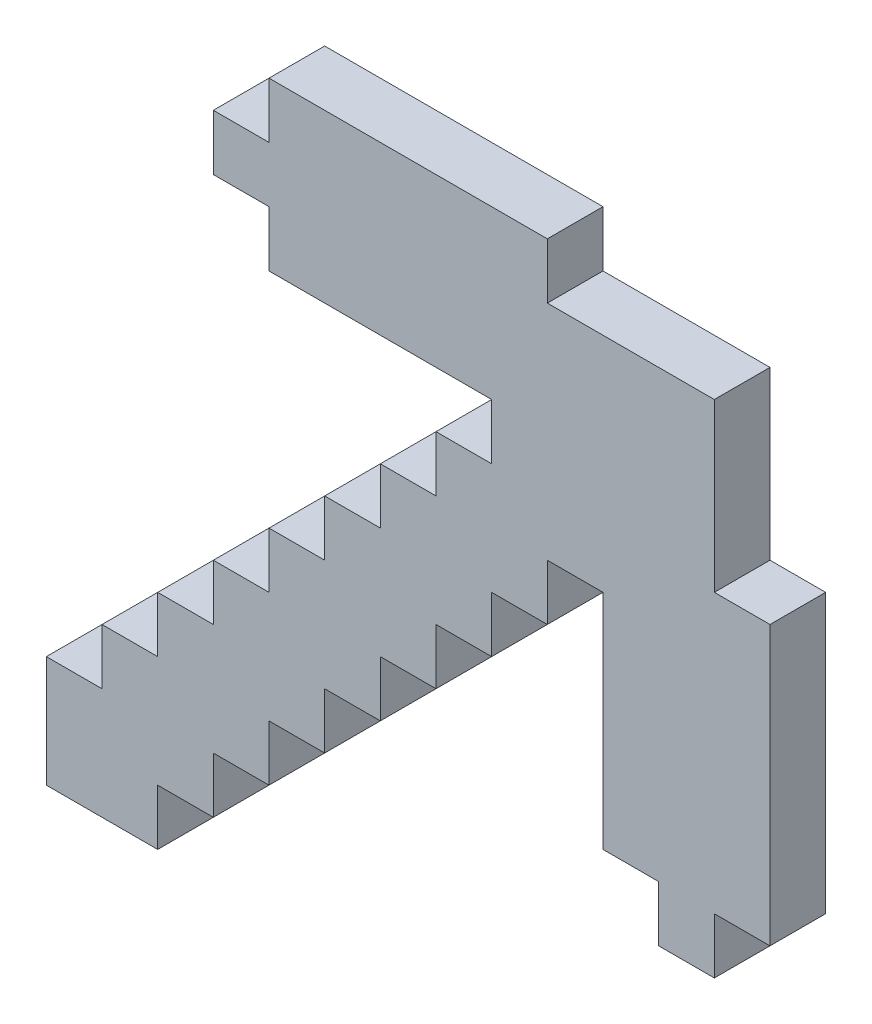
ISO-10303-21;
HEADER;
FILE_DESCRIPTION(('STEP AP214'),'2;1');
FILE_NAME('part.step','',(''),(''),'','','');
FILE_SCHEMA(('AUTOMOTIVE_DESIGN { 1 0 10303 214 1 1 1 1 }'));
ENDSEC;
DATA;
#1=APPLICATION_CONTEXT('core data for automotive mechanical design processes');
#2=APPLICATION_PROTOCOL_DEFINITION('international standard','automotive_design',2000,#1);
#3=PRODUCT_CONTEXT('',#1,'mechanical');
#4=PRODUCT('Part','Part','',(#3));
#5=PRODUCT_RELATED_PRODUCT_CATEGORY('part','',(#4));
#6=PRODUCT_DEFINITION_FORMATION('','',#4);
#7=PRODUCT_DEFINITION_CONTEXT('part definition',#1,'design');
#8=PRODUCT_DEFINITION('design','',#6,#7);
#9=PRODUCT_DEFINITION_SHAPE('','',#8);
#10=(LENGTH_UNIT() NAMED_UNIT(*) SI_UNIT(.MILLI.,.METRE.));
#11=(NAMED_UNIT(*) PLANE_ANGLE_UNIT() SI_UNIT($,.RADIAN.));
#12=(NAMED_UNIT(*) SI_UNIT($,.STERADIAN.) SOLID_ANGLE_UNIT());
#13=UNCERTAINTY_MEASURE_WITH_UNIT(LENGTH_MEASURE(1.E-05),#10,'distance_accuracy_value','');
#14=(GEOMETRIC_REPRESENTATION_CONTEXT(3) GLOBAL_UNCERTAINTY_ASSIGNED_CONTEXT((#13)) GLOBAL_UNIT_ASSIGNED_CONTEXT((#10,
#11,#12)) REPRESENTATION_CONTEXT('',''));
#15=CARTESIAN_POINT('',(0.,0.,0.));
#16=DIRECTION('',(0.,0.,1.));
#17=DIRECTION('',(1.,0.,0.));
#18=AXIS2_PLACEMENT_3D('',#15,#16,#17);
#19=CARTESIAN_POINT('',(0.,0.,4.7625));
#20=DIRECTION('',(1.,0.,0.));
#21=DIRECTION('',(0.,1.,0.));
#22=AXIS2_PLACEMENT_3D('',#19,#20,#21);
#23=PLANE('',#22);
#24=DIRECTION('',(0.,-1.,0.));
#25=VECTOR('',#24,1.);
#26=CARTESIAN_POINT('',(0.,0.,0.));
#27=LINE('',#26,#25);
#28=CARTESIAN_POINT('',(0.,9.525,0.));
#29=VERTEX_POINT('',#28);
#30=CARTESIAN_POINT('',(0.,0.,0.));
#31=VERTEX_POINT('',#30);
#32=EDGE_CURVE('E403',#29,#31,#27,.T.);
#33=ORIENTED_EDGE('',*,*,#32,.T.);
#34=DIRECTION('',(0.,0.,-1.));
#35=VECTOR('',#34,1.);
#36=CARTESIAN_POINT('',(0.,0.,4.7625));
#37=LINE('',#36,#35);
#38=CARTESIAN_POINT('',(0.,0.,4.7625));
#39=VERTEX_POINT('',#38);
#40=EDGE_CURVE('E11',#39,#31,#37,.T.);
#41=ORIENTED_EDGE('',*,*,#40,.F.);
#42=DIRECTION('',(0.,-1.,0.));
#43=VECTOR('',#42,1.);
#44=CARTESIAN_POINT('',(0.,0.,4.7625));
#45=LINE('',#44,#43);
#46=CARTESIAN_POINT('',(0.,9.525,4.7625));
#47=VERTEX_POINT('',#46);
#48=EDGE_CURVE('E505',#47,#39,#45,.T.);
#49=ORIENTED_EDGE('',*,*,#48,.F.);
#50=DIRECTION('',(0.,0.,-1.));
#51=VECTOR('',#50,1.);
#52=CARTESIAN_POINT('',(0.,9.525,4.7625));
#53=LINE('',#52,#51);
#54=EDGE_CURVE('E399',#47,#29,#53,.T.);
#55=ORIENTED_EDGE('',*,*,#54,.T.);
#56=EDGE_LOOP('',(#33,#41,#49,#55));
#57=FACE_BOUND('',#56,.T.);
#58=ADVANCED_FACE('F43',(#57),#23,.F.);
#59=CARTESIAN_POINT('',(0.,0.,4.7625));
#60=DIRECTION('',(0.,1.,0.));
#61=DIRECTION('',(0.,0.,1.));
#62=AXIS2_PLACEMENT_3D('',#59,#60,#61);
#63=PLANE('',#62);
#64=DIRECTION('',(1.,0.,0.));
#65=VECTOR('',#64,1.);
#66=CARTESIAN_POINT('',(0.,0.,0.));
#67=LINE('',#66,#65);
#68=CARTESIAN_POINT('',(9.525,0.,0.));
#69=VERTEX_POINT('',#68);
#70=EDGE_CURVE('E406',#31,#69,#67,.T.);
#71=ORIENTED_EDGE('',*,*,#70,.T.);
#72=DIRECTION('',(0.,0.,-1.));
#73=VECTOR('',#72,1.);
#74=CARTESIAN_POINT('',(9.525,0.,4.7625));
#75=LINE('',#74,#73);
#76=CARTESIAN_POINT('',(9.525,0.,4.7625));
#77=VERTEX_POINT('',#76);
#78=EDGE_CURVE('E51',#77,#69,#75,.T.);
#79=ORIENTED_EDGE('',*,*,#78,.F.);
#80=DIRECTION('',(1.,0.,0.));
#81=VECTOR('',#80,1.);
#82=CARTESIAN_POINT('',(0.,0.,4.7625));
#83=LINE('',#82,#81);
#84=EDGE_CURVE('E234',#39,#77,#83,.T.);
#85=ORIENTED_EDGE('',*,*,#84,.F.);
#86=ORIENTED_EDGE('',*,*,#40,.T.);
#87=EDGE_LOOP('',(#71,#79,#85,#86));
#88=FACE_BOUND('',#87,.T.);
#89=ADVANCED_FACE('F783',(#88),#63,.F.);
#90=CARTESIAN_POINT('',(9.525,0.,4.7625));
#91=DIRECTION('',(-1.,0.,0.));
#92=DIRECTION('',(0.,0.,1.));
#93=AXIS2_PLACEMENT_3D('',#90,#91,#92);
#94=PLANE('',#93);
#95=DIRECTION('',(0.,1.,0.));
#96=VECTOR('',#95,1.);
#97=CARTESIAN_POINT('',(9.525,0.,0.));
#98=LINE('',#97,#96);
#99=CARTESIAN_POINT('',(9.525,4.7625,0.));
#100=VERTEX_POINT('',#99);
#101=EDGE_CURVE('E408',#69,#100,#98,.T.);
#102=ORIENTED_EDGE('',*,*,#101,.T.);
#103=DIRECTION('',(0.,0.,-1.));
#104=VECTOR('',#103,1.);
#105=CARTESIAN_POINT('',(9.525,4.7625,4.7625));
#106=LINE('',#105,#104);
#107=CARTESIAN_POINT('',(9.525,4.7625,4.7625));
#108=VERTEX_POINT('',#107);
#109=EDGE_CURVE('E644',#108,#100,#106,.T.);
#110=ORIENTED_EDGE('',*,*,#109,.F.);
#111=DIRECTION('',(0.,1.,0.));
#112=VECTOR('',#111,1.);
#113=CARTESIAN_POINT('',(9.525,0.,4.7625));
#114=LINE('',#113,#112);
#115=EDGE_CURVE('E652',#77,#108,#114,.T.);
#116=ORIENTED_EDGE('',*,*,#115,.F.);
#117=ORIENTED_EDGE('',*,*,#78,.T.);
#118=EDGE_LOOP('',(#102,#110,#116,#117));
#119=FACE_BOUND('',#118,.T.);
#120=ADVANCED_FACE('F650',(#119),#94,.F.);
#121=CARTESIAN_POINT('',(9.525,4.7625,4.7625));
#122=DIRECTION('',(0.,1.,0.));
#123=DIRECTION('',(0.,0.,1.));
#124=AXIS2_PLACEMENT_3D('',#121,#122,#123);
#125=PLANE('',#124);
#126=DIRECTION('',(1.,0.,0.));
#127=VECTOR('',#126,1.);
#128=CARTESIAN_POINT('',(9.525,4.7625,0.));
#129=LINE('',#128,#127);
#130=CARTESIAN_POINT('',(14.2875,4.7625,0.));
#131=VERTEX_POINT('',#130);
#132=EDGE_CURVE('E410',#100,#131,#129,.T.);
#133=ORIENTED_EDGE('',*,*,#132,.T.);
#134=DIRECTION('',(0.,0.,-1.));
#135=VECTOR('',#134,1.);
#136=CARTESIAN_POINT('',(14.2875,4.7625,4.7625));
#137=LINE('',#136,#135);
#138=CARTESIAN_POINT('',(14.2875,4.7625,4.7625));
#139=VERTEX_POINT('',#138);
#140=EDGE_CURVE('E641',#139,#131,#137,.T.);
#141=ORIENTED_EDGE('',*,*,#140,.F.);
#142=DIRECTION('',(1.,0.,0.));
#143=VECTOR('',#142,1.);
#144=CARTESIAN_POINT('',(9.525,4.7625,4.7625));
#145=LINE('',#144,#143);
#146=EDGE_CURVE('E670',#108,#139,#145,.T.);
#147=ORIENTED_EDGE('',*,*,#146,.F.);
#148=ORIENTED_EDGE('',*,*,#109,.T.);
#149=EDGE_LOOP('',(#133,#141,#147,#148));
#150=FACE_BOUND('',#149,.T.);
#151=ADVANCED_FACE('F661',(#150),#125,.F.);
#152=CARTESIAN_POINT('',(14.2875,4.7625,4.7625));
#153=DIRECTION('',(-1.,0.,0.));
#154=DIRECTION('',(0.,-1.,0.));
#155=AXIS2_PLACEMENT_3D('',#152,#153,#154);
#156=PLANE('',#155);
#157=DIRECTION('',(0.,1.,0.));
#158=VECTOR('',#157,1.);
#159=CARTESIAN_POINT('',(14.2875,4.7625,0.));
#160=LINE('',#159,#158);
#161=CARTESIAN_POINT('',(14.2875,9.52499999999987,0.));
#162=VERTEX_POINT('',#161);
#163=EDGE_CURVE('E412',#131,#162,#160,.T.);
#164=ORIENTED_EDGE('',*,*,#163,.T.);
#165=DIRECTION('',(0.,0.,-1.));
#166=VECTOR('',#165,1.);
#167=CARTESIAN_POINT('',(14.2875,9.52499999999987,4.7625));
#168=LINE('',#167,#166);
#169=CARTESIAN_POINT('',(14.2875,9.52499999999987,4.7625));
#170=VERTEX_POINT('',#169);
#171=EDGE_CURVE('E638',#170,#162,#168,.T.);
#172=ORIENTED_EDGE('',*,*,#171,.F.);
#173=DIRECTION('',(0.,1.,0.));
#174=VECTOR('',#173,1.);
#175=CARTESIAN_POINT('',(14.2875,4.7625,4.7625));
#176=LINE('',#175,#174);
#177=EDGE_CURVE('E667',#139,#170,#176,.T.);
#178=ORIENTED_EDGE('',*,*,#177,.F.);
#179=ORIENTED_EDGE('',*,*,#140,.T.);
#180=EDGE_LOOP('',(#164,#172,#178,#179));
#181=FACE_BOUND('',#180,.T.);
#182=ADVANCED_FACE('F665',(#181),#156,.F.);
#183=CARTESIAN_POINT('',(14.2875,9.52499999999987,4.7625));
#184=DIRECTION('',(0.,1.,0.));
#185=DIRECTION('',(-1.,0.,0.));
#186=AXIS2_PLACEMENT_3D('',#183,#184,#185);
#187=PLANE('',#186);
#188=DIRECTION('',(1.,0.,0.));
#189=VECTOR('',#188,1.);
#190=CARTESIAN_POINT('',(14.2875,9.52499999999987,0.));
#191=LINE('',#190,#189);
#192=CARTESIAN_POINT('',(19.05,9.525,0.));
#193=VERTEX_POINT('',#192);
#194=EDGE_CURVE('E414',#162,#193,#191,.T.);
#195=ORIENTED_EDGE('',*,*,#194,.T.);
#196=DIRECTION('',(0.,0.,-1.));
#197=VECTOR('',#196,1.);
#198=CARTESIAN_POINT('',(19.05,9.525,4.7625));
#199=LINE('',#198,#197);
#200=CARTESIAN_POINT('',(19.05,9.525,4.7625));
#201=VERTEX_POINT('',#200);
#202=EDGE_CURVE('E635',#201,#193,#199,.T.);
#203=ORIENTED_EDGE('',*,*,#202,.F.);
#204=DIRECTION('',(1.,0.,0.));
#205=VECTOR('',#204,1.);
#206=CARTESIAN_POINT('',(14.2875,9.52499999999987,4.7625));
#207=LINE('',#206,#205);
#208=EDGE_CURVE('E669',#170,#201,#207,.T.);
#209=ORIENTED_EDGE('',*,*,#208,.F.);
#210=ORIENTED_EDGE('',*,*,#171,.T.);
#211=EDGE_LOOP('',(#195,#203,#209,#210));
#212=FACE_BOUND('',#211,.T.);
#213=ADVANCED_FACE('F796',(#212),#187,.F.);
#214=CARTESIAN_POINT('',(19.05,9.525,4.7625));
#215=DIRECTION('',(-1.,0.,0.));
#216=DIRECTION('',(0.,0.,1.));
#217=AXIS2_PLACEMENT_3D('',#214,#215,#216);
#218=PLANE('',#217);
#219=DIRECTION('',(0.,1.,0.));
#220=VECTOR('',#219,1.);
#221=CARTESIAN_POINT('',(19.05,9.525,0.));
#222=LINE('',#221,#220);
#223=CARTESIAN_POINT('',(19.05,14.2874999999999,0.));
#224=VERTEX_POINT('',#223);
#225=EDGE_CURVE('E416',#193,#224,#222,.T.);
#226=ORIENTED_EDGE('',*,*,#225,.T.);
#227=DIRECTION('',(0.,0.,-1.));
#228=VECTOR('',#227,1.);
#229=CARTESIAN_POINT('',(19.05,14.2874999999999,4.7625));
#230=LINE('',#229,#228);
#231=CARTESIAN_POINT('',(19.05,14.2874999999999,4.7625));
#232=VERTEX_POINT('',#231);
#233=EDGE_CURVE('E632',#232,#224,#230,.T.);
#234=ORIENTED_EDGE('',*,*,#233,.F.);
#235=DIRECTION('',(0.,1.,0.));
#236=VECTOR('',#235,1.);
#237=CARTESIAN_POINT('',(19.05,9.525,4.7625));
#238=LINE('',#237,#236);
#239=EDGE_CURVE('E672',#201,#232,#238,.T.);
#240=ORIENTED_EDGE('',*,*,#239,.F.);
#241=ORIENTED_EDGE('',*,*,#202,.T.);
#242=EDGE_LOOP('',(#226,#234,#240,#241));
#243=FACE_BOUND('',#242,.T.);
#244=ADVANCED_FACE('F799',(#243),#218,.F.);
#245=CARTESIAN_POINT('',(19.05,14.2874999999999,4.7625));
#246=DIRECTION('',(0.,1.,0.));
#247=DIRECTION('',(-1.,0.,0.));
#248=AXIS2_PLACEMENT_3D('',#245,#246,#247);
#249=PLANE('',#248);
#250=DIRECTION('',(1.,0.,0.));
#251=VECTOR('',#250,1.);
#252=CARTESIAN_POINT('',(19.05,14.2874999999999,0.));
#253=LINE('',#252,#251);
#254=CARTESIAN_POINT('',(23.8125,14.2875,0.));
#255=VERTEX_POINT('',#254);
#256=EDGE_CURVE('E418',#224,#255,#253,.T.);
#257=ORIENTED_EDGE('',*,*,#256,.T.);
#258=DIRECTION('',(0.,0.,-1.));
#259=VECTOR('',#258,1.);
#260=CARTESIAN_POINT('',(23.8125,14.2875,4.7625));
#261=LINE('',#260,#259);
#262=CARTESIAN_POINT('',(23.8125,14.2875,4.7625));
#263=VERTEX_POINT('',#262);
#264=EDGE_CURVE('E629',#263,#255,#261,.T.);
#265=ORIENTED_EDGE('',*,*,#264,.F.);
#266=DIRECTION('',(1.,0.,0.));
#267=VECTOR('',#266,1.);
#268=CARTESIAN_POINT('',(19.05,14.2874999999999,4.7625));
#269=LINE('',#268,#267);
#270=EDGE_CURVE('E678',#232,#263,#269,.T.);
#271=ORIENTED_EDGE('',*,*,#270,.F.);
#272=ORIENTED_EDGE('',*,*,#233,.T.);
#273=EDGE_LOOP('',(#257,#265,#271,#272));
#274=FACE_BOUND('',#273,.T.);
#275=ADVANCED_FACE('F803',(#274),#249,.F.);
#276=CARTESIAN_POINT('',(23.8125,14.2875,4.7625));
#277=DIRECTION('',(-1.,0.,0.));
#278=DIRECTION('',(0.,0.,1.));
#279=AXIS2_PLACEMENT_3D('',#276,#277,#278);
#280=PLANE('',#279);
#281=DIRECTION('',(0.,1.,0.));
#282=VECTOR('',#281,1.);
#283=CARTESIAN_POINT('',(23.8125,14.2875,0.));
#284=LINE('',#283,#282);
#285=CARTESIAN_POINT('',(23.8125,19.05,0.));
#286=VERTEX_POINT('',#285);
#287=EDGE_CURVE('E420',#255,#286,#284,.T.);
#288=ORIENTED_EDGE('',*,*,#287,.T.);
#289=DIRECTION('',(0.,0.,-1.));
#290=VECTOR('',#289,1.);
#291=CARTESIAN_POINT('',(23.8125,19.05,4.7625));
#292=LINE('',#291,#290);
#293=CARTESIAN_POINT('',(23.8125,19.05,4.7625));
#294=VERTEX_POINT('',#293);
#295=EDGE_CURVE('E626',#294,#286,#292,.T.);
#296=ORIENTED_EDGE('',*,*,#295,.F.);
#297=DIRECTION('',(0.,1.,0.));
#298=VECTOR('',#297,1.);
#299=CARTESIAN_POINT('',(23.8125,14.2875,4.7625));
#300=LINE('',#299,#298);
#301=EDGE_CURVE('E680',#263,#294,#300,.T.);
#302=ORIENTED_EDGE('',*,*,#301,.F.);
#303=ORIENTED_EDGE('',*,*,#264,.T.);
#304=EDGE_LOOP('',(#288,#296,#302,#303));
#305=FACE_BOUND('',#304,.T.);
#306=ADVANCED_FACE('F807',(#305),#280,.F.);
#307=CARTESIAN_POINT('',(23.8125,19.05,4.7625));
#308=DIRECTION('',(0.,1.,0.));
#309=DIRECTION('',(-1.,0.,0.));
#310=AXIS2_PLACEMENT_3D('',#307,#308,#309);
#311=PLANE('',#310);
#312=DIRECTION('',(1.,0.,0.));
#313=VECTOR('',#312,1.);
#314=CARTESIAN_POINT('',(23.8125,19.05,0.));
#315=LINE('',#314,#313);
#316=CARTESIAN_POINT('',(28.575,19.05,0.));
#317=VERTEX_POINT('',#316);
#318=EDGE_CURVE('E422',#286,#317,#315,.T.);
#319=ORIENTED_EDGE('',*,*,#318,.T.);
#320=DIRECTION('',(0.,0.,-1.));
#321=VECTOR('',#320,1.);
#322=CARTESIAN_POINT('',(28.575,19.05,4.7625));
#323=LINE('',#322,#321);
#324=CARTESIAN_POINT('',(28.575,19.05,4.7625));
#325=VERTEX_POINT('',#324);
#326=EDGE_CURVE('E623',#325,#317,#323,.T.);
#327=ORIENTED_EDGE('',*,*,#326,.F.);
#328=DIRECTION('',(1.,0.,0.));
#329=VECTOR('',#328,1.);
#330=CARTESIAN_POINT('',(23.8125,19.05,4.7625));
#331=LINE('',#330,#329);
#332=EDGE_CURVE('E682',#294,#325,#331,.T.);
#333=ORIENTED_EDGE('',*,*,#332,.F.);
#334=ORIENTED_EDGE('',*,*,#295,.T.);
#335=EDGE_LOOP('',(#319,#327,#333,#334));
#336=FACE_BOUND('',#335,.T.);
#337=ADVANCED_FACE('F811',(#336),#311,.F.);
#338=CARTESIAN_POINT('',(28.575,19.05,4.7625));
#339=DIRECTION('',(-1.,0.,0.));
#340=DIRECTION('',(0.,-1.,0.));
#341=AXIS2_PLACEMENT_3D('',#338,#339,#340);
#342=PLANE('',#341);
#343=DIRECTION('',(0.,1.,0.));
#344=VECTOR('',#343,1.);
#345=CARTESIAN_POINT('',(28.575,19.05,0.));
#346=LINE('',#345,#344);
#347=CARTESIAN_POINT('',(28.575,23.8124999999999,0.));
#348=VERTEX_POINT('',#347);
#349=EDGE_CURVE('E424',#317,#348,#346,.T.);
#350=ORIENTED_EDGE('',*,*,#349,.T.);
#351=DIRECTION('',(0.,0.,-1.));
#352=VECTOR('',#351,1.);
#353=CARTESIAN_POINT('',(28.575,23.8124999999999,4.7625));
#354=LINE('',#353,#352);
#355=CARTESIAN_POINT('',(28.575,23.8124999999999,4.7625));
#356=VERTEX_POINT('',#355);
#357=EDGE_CURVE('E620',#356,#348,#354,.T.);
#358=ORIENTED_EDGE('',*,*,#357,.F.);
#359=DIRECTION('',(0.,1.,0.));
#360=VECTOR('',#359,1.);
#361=CARTESIAN_POINT('',(28.575,19.05,4.7625));
#362=LINE('',#361,#360);
#363=EDGE_CURVE('E684',#325,#356,#362,.T.);
#364=ORIENTED_EDGE('',*,*,#363,.F.);
#365=ORIENTED_EDGE('',*,*,#326,.T.);
#366=EDGE_LOOP('',(#350,#358,#364,#365));
#367=FACE_BOUND('',#366,.T.);
#368=ADVANCED_FACE('F815',(#367),#342,.F.);
#369=CARTESIAN_POINT('',(28.575,23.8124999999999,4.7625));
#370=DIRECTION('',(0.,1.,0.));
#371=DIRECTION('',(-1.,0.,0.));
#372=AXIS2_PLACEMENT_3D('',#369,#370,#371);
#373=PLANE('',#372);
#374=DIRECTION('',(1.,0.,0.));
#375=VECTOR('',#374,1.);
#376=CARTESIAN_POINT('',(28.575,23.8124999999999,0.));
#377=LINE('',#376,#375);
#378=CARTESIAN_POINT('',(33.3375,23.8125,0.));
#379=VERTEX_POINT('',#378);
#380=EDGE_CURVE('E426',#348,#379,#377,.T.);
#381=ORIENTED_EDGE('',*,*,#380,.T.);
#382=DIRECTION('',(0.,0.,-1.));
#383=VECTOR('',#382,1.);
#384=CARTESIAN_POINT('',(33.3375,23.8125,4.7625));
#385=LINE('',#384,#383);
#386=CARTESIAN_POINT('',(33.3375,23.8125,4.7625));
#387=VERTEX_POINT('',#386);
#388=EDGE_CURVE('E617',#387,#379,#385,.T.);
#389=ORIENTED_EDGE('',*,*,#388,.F.);
#390=DIRECTION('',(1.,0.,0.));
#391=VECTOR('',#390,1.);
#392=CARTESIAN_POINT('',(28.575,23.8124999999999,4.7625));
#393=LINE('',#392,#391);
#394=EDGE_CURVE('E686',#356,#387,#393,.T.);
#395=ORIENTED_EDGE('',*,*,#394,.F.);
#396=ORIENTED_EDGE('',*,*,#357,.T.);
#397=EDGE_LOOP('',(#381,#389,#395,#396));
#398=FACE_BOUND('',#397,.T.);
#399=ADVANCED_FACE('F819',(#398),#373,.F.);
#400=CARTESIAN_POINT('',(33.3375,23.8125,4.7625));
#401=DIRECTION('',(-1.,0.,0.));
#402=DIRECTION('',(0.,0.,1.));
#403=AXIS2_PLACEMENT_3D('',#400,#401,#402);
#404=PLANE('',#403);
#405=DIRECTION('',(0.,1.,0.));
#406=VECTOR('',#405,1.);
#407=CARTESIAN_POINT('',(33.3375,23.8125,0.));
#408=LINE('',#407,#406);
#409=CARTESIAN_POINT('',(33.3375,28.575,0.));
#410=VERTEX_POINT('',#409);
#411=EDGE_CURVE('E428',#379,#410,#408,.T.);
#412=ORIENTED_EDGE('',*,*,#411,.T.);
#413=DIRECTION('',(0.,0.,-1.));
#414=VECTOR('',#413,1.);
#415=CARTESIAN_POINT('',(33.3375,28.575,4.7625));
#416=LINE('',#415,#414);
#417=CARTESIAN_POINT('',(33.3375,28.575,4.7625));
#418=VERTEX_POINT('',#417);
#419=EDGE_CURVE('E614',#418,#410,#416,.T.);
#420=ORIENTED_EDGE('',*,*,#419,.F.);
#421=DIRECTION('',(0.,1.,0.));
#422=VECTOR('',#421,1.);
#423=CARTESIAN_POINT('',(33.3375,23.8125,4.7625));
#424=LINE('',#423,#422);
#425=EDGE_CURVE('E688',#387,#418,#424,.T.);
#426=ORIENTED_EDGE('',*,*,#425,.F.);
#427=ORIENTED_EDGE('',*,*,#388,.T.);
#428=EDGE_LOOP('',(#412,#420,#426,#427));
#429=FACE_BOUND('',#428,.T.);
#430=ADVANCED_FACE('F823',(#429),#404,.F.);
#431=CARTESIAN_POINT('',(33.3375,28.575,4.7625));
#432=DIRECTION('',(0.,1.,0.));
#433=DIRECTION('',(0.,0.,1.));
#434=AXIS2_PLACEMENT_3D('',#431,#432,#433);
#435=PLANE('',#434);
#436=DIRECTION('',(1.,0.,0.));
#437=VECTOR('',#436,1.);
#438=CARTESIAN_POINT('',(33.3375,28.575,0.));
#439=LINE('',#438,#437);
#440=CARTESIAN_POINT('',(38.1,28.575,0.));
#441=VERTEX_POINT('',#440);
#442=EDGE_CURVE('E430',#410,#441,#439,.T.);
#443=ORIENTED_EDGE('',*,*,#442,.T.);
#444=DIRECTION('',(0.,0.,-1.));
#445=VECTOR('',#444,1.);
#446=CARTESIAN_POINT('',(38.1,28.575,4.7625));
#447=LINE('',#446,#445);
#448=CARTESIAN_POINT('',(38.1,28.575,4.7625));
#449=VERTEX_POINT('',#448);
#450=EDGE_CURVE('E611',#449,#441,#447,.T.);
#451=ORIENTED_EDGE('',*,*,#450,.F.);
#452=DIRECTION('',(1.,0.,0.));
#453=VECTOR('',#452,1.);
#454=CARTESIAN_POINT('',(33.3375,28.575,4.7625));
#455=LINE('',#454,#453);
#456=EDGE_CURVE('E690',#418,#449,#455,.T.);
#457=ORIENTED_EDGE('',*,*,#456,.F.);
#458=ORIENTED_EDGE('',*,*,#419,.T.);
#459=EDGE_LOOP('',(#443,#451,#457,#458));
#460=FACE_BOUND('',#459,.T.);
#461=ADVANCED_FACE('F827',(#460),#435,.F.);
#462=CARTESIAN_POINT('',(38.1,28.575,4.7625));
#463=DIRECTION('',(-1.,0.,0.));
#464=DIRECTION('',(0.,-1.,0.));
#465=AXIS2_PLACEMENT_3D('',#462,#463,#464);
#466=PLANE('',#465);
#467=DIRECTION('',(0.,1.,0.));
#468=VECTOR('',#467,1.);
#469=CARTESIAN_POINT('',(38.1,28.575,0.));
#470=LINE('',#469,#468);
#471=CARTESIAN_POINT('',(38.1,33.3374999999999,0.));
#472=VERTEX_POINT('',#471);
#473=EDGE_CURVE('E432',#441,#472,#470,.T.);
#474=ORIENTED_EDGE('',*,*,#473,.T.);
#475=DIRECTION('',(0.,0.,-1.));
#476=VECTOR('',#475,1.);
#477=CARTESIAN_POINT('',(38.1,33.3374999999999,4.7625));
#478=LINE('',#477,#476);
#479=CARTESIAN_POINT('',(38.1,33.3374999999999,4.7625));
#480=VERTEX_POINT('',#479);
#481=EDGE_CURVE('E608',#480,#472,#478,.T.);
#482=ORIENTED_EDGE('',*,*,#481,.F.);
#483=DIRECTION('',(0.,1.,0.));
#484=VECTOR('',#483,1.);
#485=CARTESIAN_POINT('',(38.1,28.575,4.7625));
#486=LINE('',#485,#484);
#487=EDGE_CURVE('E692',#449,#480,#486,.T.);
#488=ORIENTED_EDGE('',*,*,#487,.F.);
#489=ORIENTED_EDGE('',*,*,#450,.T.);
#490=EDGE_LOOP('',(#474,#482,#488,#489));
#491=FACE_BOUND('',#490,.T.);
#492=ADVANCED_FACE('F831',(#491),#466,.F.);
#493=CARTESIAN_POINT('',(38.1,33.3374999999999,4.7625));
#494=DIRECTION('',(0.,1.,0.));
#495=DIRECTION('',(-1.,0.,0.));
#496=AXIS2_PLACEMENT_3D('',#493,#494,#495);
#497=PLANE('',#496);
#498=DIRECTION('',(1.,0.,0.));
#499=VECTOR('',#498,1.);
#500=CARTESIAN_POINT('',(38.1,33.3374999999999,0.));
#501=LINE('',#500,#499);
#502=CARTESIAN_POINT('',(42.8625,33.3375,0.));
#503=VERTEX_POINT('',#502);
#504=EDGE_CURVE('E434',#472,#503,#501,.T.);
#505=ORIENTED_EDGE('',*,*,#504,.T.);
#506=DIRECTION('',(0.,0.,-1.));
#507=VECTOR('',#506,1.);
#508=CARTESIAN_POINT('',(42.8625,33.3375,4.7625));
#509=LINE('',#508,#507);
#510=CARTESIAN_POINT('',(42.8625,33.3375,4.7625));
#511=VERTEX_POINT('',#510);
#512=EDGE_CURVE('E605',#511,#503,#509,.T.);
#513=ORIENTED_EDGE('',*,*,#512,.F.);
#514=DIRECTION('',(1.,0.,0.));
#515=VECTOR('',#514,1.);
#516=CARTESIAN_POINT('',(38.1,33.3374999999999,4.7625));
#517=LINE('',#516,#515);
#518=EDGE_CURVE('E694',#480,#511,#517,.T.);
#519=ORIENTED_EDGE('',*,*,#518,.F.);
#520=ORIENTED_EDGE('',*,*,#481,.T.);
#521=EDGE_LOOP('',(#505,#513,#519,#520));
#522=FACE_BOUND('',#521,.T.);
#523=ADVANCED_FACE('F835',(#522),#497,.F.);
#524=CARTESIAN_POINT('',(42.8625,33.3375,4.7625));
#525=DIRECTION('',(-1.,0.,0.));
#526=DIRECTION('',(0.,0.,1.));
#527=AXIS2_PLACEMENT_3D('',#524,#525,#526);
#528=PLANE('',#527);
#529=DIRECTION('',(0.,1.,0.));
#530=VECTOR('',#529,1.);
#531=CARTESIAN_POINT('',(42.8625,33.3375,0.));
#532=LINE('',#531,#530);
#533=CARTESIAN_POINT('',(42.8625,38.1,0.));
#534=VERTEX_POINT('',#533);
#535=EDGE_CURVE('E436',#503,#534,#532,.T.);
#536=ORIENTED_EDGE('',*,*,#535,.T.);
#537=DIRECTION('',(0.,0.,-1.));
#538=VECTOR('',#537,1.);
#539=CARTESIAN_POINT('',(42.8625,38.1,4.7625));
#540=LINE('',#539,#538);
#541=CARTESIAN_POINT('',(42.8625,38.1,4.7625));
#542=VERTEX_POINT('',#541);
#543=EDGE_CURVE('E602',#542,#534,#540,.T.);
#544=ORIENTED_EDGE('',*,*,#543,.F.);
#545=DIRECTION('',(0.,1.,0.));
#546=VECTOR('',#545,1.);
#547=CARTESIAN_POINT('',(42.8625,33.3375,4.7625));
#548=LINE('',#547,#546);
#549=EDGE_CURVE('E696',#511,#542,#548,.T.);
#550=ORIENTED_EDGE('',*,*,#549,.F.);
#551=ORIENTED_EDGE('',*,*,#512,.T.);
#552=EDGE_LOOP('',(#536,#544,#550,#551));
#553=FACE_BOUND('',#552,.T.);
#554=ADVANCED_FACE('F839',(#553),#528,.F.);
#555=CARTESIAN_POINT('',(42.8625,38.1,4.7625));
#556=DIRECTION('',(0.,1.,0.));
#557=DIRECTION('',(-1.,0.,0.));
#558=AXIS2_PLACEMENT_3D('',#555,#556,#557);
#559=PLANE('',#558);
#560=DIRECTION('',(1.,0.,0.));
#561=VECTOR('',#560,1.);
#562=CARTESIAN_POINT('',(42.8625,38.1,0.));
#563=LINE('',#562,#561);
#564=CARTESIAN_POINT('',(47.625,38.1,0.));
#565=VERTEX_POINT('',#564);
#566=EDGE_CURVE('E438',#534,#565,#563,.T.);
#567=ORIENTED_EDGE('',*,*,#566,.T.);
#568=DIRECTION('',(0.,0.,-1.));
#569=VECTOR('',#568,1.);
#570=CARTESIAN_POINT('',(47.625,38.1,4.7625));
#571=LINE('',#570,#569);
#572=CARTESIAN_POINT('',(47.625,38.1,4.7625));
#573=VERTEX_POINT('',#572);
#574=EDGE_CURVE('E599',#573,#565,#571,.T.);
#575=ORIENTED_EDGE('',*,*,#574,.F.);
#576=DIRECTION('',(1.,0.,0.));
#577=VECTOR('',#576,1.);
#578=CARTESIAN_POINT('',(42.8625,38.1,4.7625));
#579=LINE('',#578,#577);
#580=EDGE_CURVE('E698',#542,#573,#579,.T.);
#581=ORIENTED_EDGE('',*,*,#580,.F.);
#582=ORIENTED_EDGE('',*,*,#543,.T.);
#583=EDGE_LOOP('',(#567,#575,#581,#582));
#584=FACE_BOUND('',#583,.T.);
#585=ADVANCED_FACE('F843',(#584),#559,.F.);
#586=CARTESIAN_POINT('',(47.625,38.1,4.7625));
#587=DIRECTION('',(1.,0.,0.));
#588=DIRECTION('',(0.,0.,-1.));
#589=AXIS2_PLACEMENT_3D('',#586,#587,#588);
#590=PLANE('',#589);
#591=DIRECTION('',(0.,-1.,0.));
#592=VECTOR('',#591,1.);
#593=CARTESIAN_POINT('',(47.625,38.1,0.));
#594=LINE('',#593,#592);
#595=CARTESIAN_POINT('',(47.625,19.05,0.));
#596=VERTEX_POINT('',#595);
#597=EDGE_CURVE('E440',#565,#596,#594,.T.);
#598=ORIENTED_EDGE('',*,*,#597,.T.);
#599=DIRECTION('',(0.,0.,-1.));
#600=VECTOR('',#599,1.);
#601=CARTESIAN_POINT('',(47.625,19.05,4.7625));
#602=LINE('',#601,#600);
#603=CARTESIAN_POINT('',(47.625,19.05,4.7625));
#604=VERTEX_POINT('',#603);
#605=EDGE_CURVE('E596',#604,#596,#602,.T.);
#606=ORIENTED_EDGE('',*,*,#605,.F.);
#607=DIRECTION('',(0.,-1.,0.));
#608=VECTOR('',#607,1.);
#609=CARTESIAN_POINT('',(47.625,38.1,4.7625));
#610=LINE('',#609,#608);
#611=EDGE_CURVE('E700',#573,#604,#610,.T.);
#612=ORIENTED_EDGE('',*,*,#611,.F.);
#613=ORIENTED_EDGE('',*,*,#574,.T.);
#614=EDGE_LOOP('',(#598,#606,#612,#613));
#615=FACE_BOUND('',#614,.T.);
#616=ADVANCED_FACE('F847',(#615),#590,.F.);
#617=CARTESIAN_POINT('',(47.625,19.05,4.7625));
#618=DIRECTION('',(0.,1.,0.));
#619=DIRECTION('',(-1.,0.,0.));
#620=AXIS2_PLACEMENT_3D('',#617,#618,#619);
#621=PLANE('',#620);
#622=DIRECTION('',(1.,0.,0.));
#623=VECTOR('',#622,1.);
#624=CARTESIAN_POINT('',(47.625,19.05,0.));
#625=LINE('',#624,#623);
#626=CARTESIAN_POINT('',(52.3875,19.05,0.));
#627=VERTEX_POINT('',#626);
#628=EDGE_CURVE('E442',#596,#627,#625,.T.);
#629=ORIENTED_EDGE('',*,*,#628,.T.);
#630=DIRECTION('',(0.,0.,-1.));
#631=VECTOR('',#630,1.);
#632=CARTESIAN_POINT('',(52.3875,19.05,4.7625));
#633=LINE('',#632,#631);
#634=CARTESIAN_POINT('',(52.3875,19.05,4.7625));
#635=VERTEX_POINT('',#634);
#636=EDGE_CURVE('E593',#635,#627,#633,.T.);
#637=ORIENTED_EDGE('',*,*,#636,.F.);
#638=DIRECTION('',(1.,0.,0.));
#639=VECTOR('',#638,1.);
#640=CARTESIAN_POINT('',(47.625,19.05,4.7625));
#641=LINE('',#640,#639);
#642=EDGE_CURVE('E702',#604,#635,#641,.T.);
#643=ORIENTED_EDGE('',*,*,#642,.F.);
#644=ORIENTED_EDGE('',*,*,#605,.T.);
#645=EDGE_LOOP('',(#629,#637,#643,#644));
#646=FACE_BOUND('',#645,.T.);
#647=ADVANCED_FACE('F851',(#646),#621,.F.);
#648=CARTESIAN_POINT('',(52.3875,19.05,4.7625));
#649=DIRECTION('',(1.,0.,0.));
#650=DIRECTION('',(0.,1.,0.));
#651=AXIS2_PLACEMENT_3D('',#648,#649,#650);
#652=PLANE('',#651);
#653=DIRECTION('',(0.,-1.,0.));
#654=VECTOR('',#653,1.);
#655=CARTESIAN_POINT('',(52.3875,19.05,0.));
#656=LINE('',#655,#654);
#657=CARTESIAN_POINT('',(52.3875,14.2874999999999,0.));
#658=VERTEX_POINT('',#657);
#659=EDGE_CURVE('E444',#627,#658,#656,.T.);
#660=ORIENTED_EDGE('',*,*,#659,.T.);
#661=DIRECTION('',(0.,0.,-1.));
#662=VECTOR('',#661,1.);
#663=CARTESIAN_POINT('',(52.3875,14.2874999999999,4.7625));
#664=LINE('',#663,#662);
#665=CARTESIAN_POINT('',(52.3875,14.2874999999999,4.7625));
#666=VERTEX_POINT('',#665);
#667=EDGE_CURVE('E590',#666,#658,#664,.T.);
#668=ORIENTED_EDGE('',*,*,#667,.F.);
#669=DIRECTION('',(0.,-1.,0.));
#670=VECTOR('',#669,1.);
#671=CARTESIAN_POINT('',(52.3875,19.05,4.7625));
#672=LINE('',#671,#670);
#673=EDGE_CURVE('E704',#635,#666,#672,.T.);
#674=ORIENTED_EDGE('',*,*,#673,.F.);
#675=ORIENTED_EDGE('',*,*,#636,.T.);
#676=EDGE_LOOP('',(#660,#668,#674,#675));
#677=FACE_BOUND('',#676,.T.);
#678=ADVANCED_FACE('F855',(#677),#652,.F.);
#679=CARTESIAN_POINT('',(52.3875,14.2874999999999,4.7625));
#680=DIRECTION('',(0.,1.,0.));
#681=DIRECTION('',(0.,0.,1.));
#682=AXIS2_PLACEMENT_3D('',#679,#680,#681);
#683=PLANE('',#682);
#684=DIRECTION('',(1.,0.,0.));
#685=VECTOR('',#684,1.);
#686=CARTESIAN_POINT('',(52.3875,14.2874999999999,0.));
#687=LINE('',#686,#685);
#688=CARTESIAN_POINT('',(57.15,14.2874999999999,0.));
#689=VERTEX_POINT('',#688);
#690=EDGE_CURVE('E446',#658,#689,#687,.T.);
#691=ORIENTED_EDGE('',*,*,#690,.T.);
#692=DIRECTION('',(0.,0.,-1.));
#693=VECTOR('',#692,1.);
#694=CARTESIAN_POINT('',(57.15,14.2874999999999,4.7625));
#695=LINE('',#694,#693);
#696=CARTESIAN_POINT('',(57.15,14.2874999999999,4.7625));
#697=VERTEX_POINT('',#696);
#698=EDGE_CURVE('E587',#697,#689,#695,.T.);
#699=ORIENTED_EDGE('',*,*,#698,.F.);
#700=DIRECTION('',(1.,0.,0.));
#701=VECTOR('',#700,1.);
#702=CARTESIAN_POINT('',(52.3875,14.2874999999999,4.7625));
#703=LINE('',#702,#701);
#704=EDGE_CURVE('E706',#666,#697,#703,.T.);
#705=ORIENTED_EDGE('',*,*,#704,.F.);
#706=ORIENTED_EDGE('',*,*,#667,.T.);
#707=EDGE_LOOP('',(#691,#699,#705,#706));
#708=FACE_BOUND('',#707,.T.);
#709=ADVANCED_FACE('F859',(#708),#683,.F.);
#710=CARTESIAN_POINT('',(57.15,14.2874999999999,4.7625));
#711=DIRECTION('',(-1.,0.,0.));
#712=DIRECTION('',(0.,0.,1.));
#713=AXIS2_PLACEMENT_3D('',#710,#711,#712);
#714=PLANE('',#713);
#715=DIRECTION('',(0.,1.,0.));
#716=VECTOR('',#715,1.);
#717=CARTESIAN_POINT('',(57.15,14.2874999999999,0.));
#718=LINE('',#717,#716);
#719=CARTESIAN_POINT('',(57.15,19.0499999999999,0.));
#720=VERTEX_POINT('',#719);
#721=EDGE_CURVE('E448',#689,#720,#718,.T.);
#722=ORIENTED_EDGE('',*,*,#721,.T.);
#723=DIRECTION('',(0.,0.,-1.));
#724=VECTOR('',#723,1.);
#725=CARTESIAN_POINT('',(57.15,19.0499999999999,4.7625));
#726=LINE('',#725,#724);
#727=CARTESIAN_POINT('',(57.15,19.0499999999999,4.7625));
#728=VERTEX_POINT('',#727);
#729=EDGE_CURVE('E584',#728,#720,#726,.T.);
#730=ORIENTED_EDGE('',*,*,#729,.F.);
#731=DIRECTION('',(0.,1.,0.));
#732=VECTOR('',#731,1.);
#733=CARTESIAN_POINT('',(57.15,14.2874999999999,4.7625));
#734=LINE('',#733,#732);
#735=EDGE_CURVE('E708',#697,#728,#734,.T.);
#736=ORIENTED_EDGE('',*,*,#735,.F.);
#737=ORIENTED_EDGE('',*,*,#698,.T.);
#738=EDGE_LOOP('',(#722,#730,#736,#737));
#739=FACE_BOUND('',#738,.T.);
#740=ADVANCED_FACE('F863',(#739),#714,.F.);
#741=CARTESIAN_POINT('',(57.15,19.0499999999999,4.7625));
#742=DIRECTION('',(0.,1.,0.));
#743=DIRECTION('',(0.,0.,1.));
#744=AXIS2_PLACEMENT_3D('',#741,#742,#743);
#745=PLANE('',#744);
#746=DIRECTION('',(1.,0.,0.));
#747=VECTOR('',#746,1.);
#748=CARTESIAN_POINT('',(57.15,19.0499999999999,0.));
#749=LINE('',#748,#747);
#750=CARTESIAN_POINT('',(61.9125,19.0499999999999,0.));
#751=VERTEX_POINT('',#750);
#752=EDGE_CURVE('E450',#720,#751,#749,.T.);
#753=ORIENTED_EDGE('',*,*,#752,.T.);
#754=DIRECTION('',(0.,0.,-1.));
#755=VECTOR('',#754,1.);
#756=CARTESIAN_POINT('',(61.9125,19.0499999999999,4.7625));
#757=LINE('',#756,#755);
#758=CARTESIAN_POINT('',(61.9125,19.0499999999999,4.7625));
#759=VERTEX_POINT('',#758);
#760=EDGE_CURVE('E581',#759,#751,#757,.T.);
#761=ORIENTED_EDGE('',*,*,#760,.F.);
#762=DIRECTION('',(1.,0.,0.));
#763=VECTOR('',#762,1.);
#764=CARTESIAN_POINT('',(57.15,19.0499999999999,4.7625));
#765=LINE('',#764,#763);
#766=EDGE_CURVE('E710',#728,#759,#765,.T.);
#767=ORIENTED_EDGE('',*,*,#766,.F.);
#768=ORIENTED_EDGE('',*,*,#729,.T.);
#769=EDGE_LOOP('',(#753,#761,#767,#768));
#770=FACE_BOUND('',#769,.T.);
#771=ADVANCED_FACE('F867',(#770),#745,.F.);
#772=CARTESIAN_POINT('',(61.9125,19.0499999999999,4.7625));
#773=DIRECTION('',(-1.,0.,0.));
#774=DIRECTION('',(0.,0.,1.));
#775=AXIS2_PLACEMENT_3D('',#772,#773,#774);
#776=PLANE('',#775);
#777=DIRECTION('',(0.,1.,0.));
#778=VECTOR('',#777,1.);
#779=CARTESIAN_POINT('',(61.9125,19.0499999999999,0.));
#780=LINE('',#779,#778);
#781=CARTESIAN_POINT('',(61.9125,42.8624999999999,0.));
#782=VERTEX_POINT('',#781);
#783=EDGE_CURVE('E452',#751,#782,#780,.T.);
#784=ORIENTED_EDGE('',*,*,#783,.T.);
#785=DIRECTION('',(0.,0.,-1.));
#786=VECTOR('',#785,1.);
#787=CARTESIAN_POINT('',(61.9125,42.8624999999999,4.7625));
#788=LINE('',#787,#786);
#789=CARTESIAN_POINT('',(61.9125,42.8624999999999,4.7625));
#790=VERTEX_POINT('',#789);
#791=EDGE_CURVE('E578',#790,#782,#788,.T.);
#792=ORIENTED_EDGE('',*,*,#791,.F.);
#793=DIRECTION('',(0.,1.,0.));
#794=VECTOR('',#793,1.);
#795=CARTESIAN_POINT('',(61.9125,19.0499999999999,4.7625));
#796=LINE('',#795,#794);
#797=EDGE_CURVE('E712',#759,#790,#796,.T.);
#798=ORIENTED_EDGE('',*,*,#797,.F.);
#799=ORIENTED_EDGE('',*,*,#760,.T.);
#800=EDGE_LOOP('',(#784,#792,#798,#799));
#801=FACE_BOUND('',#800,.T.);
#802=ADVANCED_FACE('F871',(#801),#776,.F.);
#803=CARTESIAN_POINT('',(61.9125,42.8624999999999,4.7625));
#804=DIRECTION('',(0.,-1.,0.));
#805=DIRECTION('',(0.,0.,-1.));
#806=AXIS2_PLACEMENT_3D('',#803,#804,#805);
#807=PLANE('',#806);
#808=DIRECTION('',(-1.,0.,0.));
#809=VECTOR('',#808,1.);
#810=CARTESIAN_POINT('',(61.9125,42.8624999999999,0.));
#811=LINE('',#810,#809);
#812=CARTESIAN_POINT('',(57.15,42.8624999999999,0.));
#813=VERTEX_POINT('',#812);
#814=EDGE_CURVE('E454',#782,#813,#811,.T.);
#815=ORIENTED_EDGE('',*,*,#814,.T.);
#816=DIRECTION('',(0.,0.,-1.));
#817=VECTOR('',#816,1.);
#818=CARTESIAN_POINT('',(57.15,42.8624999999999,4.7625));
#819=LINE('',#818,#817);
#820=CARTESIAN_POINT('',(57.15,42.8624999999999,4.7625));
#821=VERTEX_POINT('',#820);
#822=EDGE_CURVE('E575',#821,#813,#819,.T.);
#823=ORIENTED_EDGE('',*,*,#822,.F.);
#824=DIRECTION('',(-1.,0.,0.));
#825=VECTOR('',#824,1.);
#826=CARTESIAN_POINT('',(61.9125,42.8624999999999,4.7625));
#827=LINE('',#826,#825);
#828=EDGE_CURVE('E714',#790,#821,#827,.T.);
#829=ORIENTED_EDGE('',*,*,#828,.F.);
#830=ORIENTED_EDGE('',*,*,#791,.T.);
#831=EDGE_LOOP('',(#815,#823,#829,#830));
#832=FACE_BOUND('',#831,.T.);
#833=ADVANCED_FACE('F875',(#832),#807,.F.);
#834=CARTESIAN_POINT('',(57.15,42.8624999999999,4.7625));
#835=DIRECTION('',(-1.,0.,0.));
#836=DIRECTION('',(0.,-1.,0.));
#837=AXIS2_PLACEMENT_3D('',#834,#835,#836);
#838=PLANE('',#837);
#839=DIRECTION('',(0.,1.,0.));
#840=VECTOR('',#839,1.);
#841=CARTESIAN_POINT('',(57.15,42.8624999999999,0.));
#842=LINE('',#841,#840);
#843=CARTESIAN_POINT('',(57.15,57.1499999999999,0.));
#844=VERTEX_POINT('',#843);
#845=EDGE_CURVE('E456',#813,#844,#842,.T.);
#846=ORIENTED_EDGE('',*,*,#845,.T.);
#847=DIRECTION('',(0.,0.,-1.));
#848=VECTOR('',#847,1.);
#849=CARTESIAN_POINT('',(57.15,57.1499999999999,4.7625));
#850=LINE('',#849,#848);
#851=CARTESIAN_POINT('',(57.15,57.1499999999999,4.7625));
#852=VERTEX_POINT('',#851);
#853=EDGE_CURVE('E572',#852,#844,#850,.T.);
#854=ORIENTED_EDGE('',*,*,#853,.F.);
#855=DIRECTION('',(0.,1.,0.));
#856=VECTOR('',#855,1.);
#857=CARTESIAN_POINT('',(57.15,42.8624999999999,4.7625));
#858=LINE('',#857,#856);
#859=EDGE_CURVE('E716',#821,#852,#858,.T.);
#860=ORIENTED_EDGE('',*,*,#859,.F.);
#861=ORIENTED_EDGE('',*,*,#822,.T.);
#862=EDGE_LOOP('',(#846,#854,#860,#861));
#863=FACE_BOUND('',#862,.T.);
#864=ADVANCED_FACE('F879',(#863),#838,.F.);
#865=CARTESIAN_POINT('',(42.8625,57.1499999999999,4.7625));
#866=DIRECTION('',(0.,-1.,0.));
#867=DIRECTION('',(1.,0.,0.));
#868=AXIS2_PLACEMENT_3D('',#865,#866,#867);
#869=PLANE('',#868);
#870=DIRECTION('',(-1.,0.,0.));
#871=VECTOR('',#870,1.);
#872=CARTESIAN_POINT('',(42.8625,57.1499999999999,0.));
#873=LINE('',#872,#871);
#874=CARTESIAN_POINT('',(42.8625,57.1499999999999,0.));
#875=VERTEX_POINT('',#874);
#876=EDGE_CURVE('E458',#844,#875,#873,.T.);
#877=ORIENTED_EDGE('',*,*,#876,.T.);
#878=DIRECTION('',(0.,0.,-1.));
#879=VECTOR('',#878,1.);
#880=CARTESIAN_POINT('',(42.8625,57.1499999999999,4.7625));
#881=LINE('',#880,#879);
#882=CARTESIAN_POINT('',(42.8625,57.1499999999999,4.7625));
#883=VERTEX_POINT('',#882);
#884=EDGE_CURVE('E569',#883,#875,#881,.T.);
#885=ORIENTED_EDGE('',*,*,#884,.F.);
#886=DIRECTION('',(-1.,0.,0.));
#887=VECTOR('',#886,1.);
#888=CARTESIAN_POINT('',(42.8625,57.1499999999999,4.7625));
#889=LINE('',#888,#887);
#890=EDGE_CURVE('E718',#852,#883,#889,.T.);
#891=ORIENTED_EDGE('',*,*,#890,.F.);
#892=ORIENTED_EDGE('',*,*,#853,.T.);
#893=EDGE_LOOP('',(#877,#885,#891,#892));
#894=FACE_BOUND('',#893,.T.);
#895=ADVANCED_FACE('F883',(#894),#869,.F.);
#896=CARTESIAN_POINT('',(42.8625,61.9124999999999,4.7625));
#897=DIRECTION('',(-1.,0.,0.));
#898=DIRECTION('',(0.,-1.,0.));
#899=AXIS2_PLACEMENT_3D('',#896,#897,#898);
#900=PLANE('',#899);
#901=DIRECTION('',(0.,1.,0.));
#902=VECTOR('',#901,1.);
#903=CARTESIAN_POINT('',(42.8625,61.9124999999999,0.));
#904=LINE('',#903,#902);
#905=CARTESIAN_POINT('',(42.8625,61.9124999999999,0.));
#906=VERTEX_POINT('',#905);
#907=EDGE_CURVE('E460',#875,#906,#904,.T.);
#908=ORIENTED_EDGE('',*,*,#907,.T.);
#909=DIRECTION('',(0.,0.,-1.));
#910=VECTOR('',#909,1.);
#911=CARTESIAN_POINT('',(42.8625,61.9124999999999,4.7625));
#912=LINE('',#911,#910);
#913=CARTESIAN_POINT('',(42.8625,61.9124999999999,4.7625));
#914=VERTEX_POINT('',#913);
#915=EDGE_CURVE('E566',#914,#906,#912,.T.);
#916=ORIENTED_EDGE('',*,*,#915,.F.);
#917=DIRECTION('',(0.,1.,0.));
#918=VECTOR('',#917,1.);
#919=CARTESIAN_POINT('',(42.8625,61.9124999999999,4.7625));
#920=LINE('',#919,#918);
#921=EDGE_CURVE('E720',#883,#914,#920,.T.);
#922=ORIENTED_EDGE('',*,*,#921,.F.);
#923=ORIENTED_EDGE('',*,*,#884,.T.);
#924=EDGE_LOOP('',(#908,#916,#922,#923));
#925=FACE_BOUND('',#924,.T.);
#926=ADVANCED_FACE('F887',(#925),#900,.F.);
#927=CARTESIAN_POINT('',(19.05,61.9125,4.7625));
#928=DIRECTION('',(0.,-1.,0.));
#929=DIRECTION('',(1.,0.,0.));
#930=AXIS2_PLACEMENT_3D('',#927,#928,#929);
#931=PLANE('',#930);
#932=DIRECTION('',(-1.,0.,0.));
#933=VECTOR('',#932,1.);
#934=CARTESIAN_POINT('',(19.05,61.9125,0.));
#935=LINE('',#934,#933);
#936=CARTESIAN_POINT('',(19.05,61.9125,0.));
#937=VERTEX_POINT('',#936);
#938=EDGE_CURVE('E462',#906,#937,#935,.T.);
#939=ORIENTED_EDGE('',*,*,#938,.T.);
#940=DIRECTION('',(0.,0.,-1.));
#941=VECTOR('',#940,1.);
#942=CARTESIAN_POINT('',(19.05,61.9125,4.7625));
#943=LINE('',#942,#941);
#944=CARTESIAN_POINT('',(19.05,61.9125,4.7625));
#945=VERTEX_POINT('',#944);
#946=EDGE_CURVE('E563',#945,#937,#943,.T.);
#947=ORIENTED_EDGE('',*,*,#946,.F.);
#948=DIRECTION('',(-1.,0.,0.));
#949=VECTOR('',#948,1.);
#950=CARTESIAN_POINT('',(19.05,61.9125,4.7625));
#951=LINE('',#950,#949);
#952=EDGE_CURVE('E722',#914,#945,#951,.T.);
#953=ORIENTED_EDGE('',*,*,#952,.F.);
#954=ORIENTED_EDGE('',*,*,#915,.T.);
#955=EDGE_LOOP('',(#939,#947,#953,#954));
#956=FACE_BOUND('',#955,.T.);
#957=ADVANCED_FACE('F891',(#956),#931,.F.);
#958=CARTESIAN_POINT('',(19.05,57.15,4.7625));
#959=DIRECTION('',(1.,0.,0.));
#960=DIRECTION('',(0.,0.,-1.));
#961=AXIS2_PLACEMENT_3D('',#958,#959,#960);
#962=PLANE('',#961);
#963=DIRECTION('',(0.,-1.,0.));
#964=VECTOR('',#963,1.);
#965=CARTESIAN_POINT('',(19.05,57.15,0.));
#966=LINE('',#965,#964);
#967=CARTESIAN_POINT('',(19.05,57.15,0.));
#968=VERTEX_POINT('',#967);
#969=EDGE_CURVE('E464',#937,#968,#966,.T.);
#970=ORIENTED_EDGE('',*,*,#969,.T.);
#971=DIRECTION('',(0.,0.,-1.));
#972=VECTOR('',#971,1.);
#973=CARTESIAN_POINT('',(19.05,57.15,4.7625));
#974=LINE('',#973,#972);
#975=CARTESIAN_POINT('',(19.05,57.15,4.7625));
#976=VERTEX_POINT('',#975);
#977=EDGE_CURVE('E560',#976,#968,#974,.T.);
#978=ORIENTED_EDGE('',*,*,#977,.F.);
#979=DIRECTION('',(0.,-1.,0.));
#980=VECTOR('',#979,1.);
#981=CARTESIAN_POINT('',(19.05,57.15,4.7625));
#982=LINE('',#981,#980);
#983=EDGE_CURVE('E724',#945,#976,#982,.T.);
#984=ORIENTED_EDGE('',*,*,#983,.F.);
#985=ORIENTED_EDGE('',*,*,#946,.T.);
#986=EDGE_LOOP('',(#970,#978,#984,#985));
#987=FACE_BOUND('',#986,.T.);
#988=ADVANCED_FACE('F895',(#987),#962,.F.);
#989=CARTESIAN_POINT('',(14.2875,57.15,4.7625));
#990=DIRECTION('',(0.,-1.,0.));
#991=DIRECTION('',(1.,0.,0.));
#992=AXIS2_PLACEMENT_3D('',#989,#990,#991);
#993=PLANE('',#992);
#994=DIRECTION('',(-1.,0.,0.));
#995=VECTOR('',#994,1.);
#996=CARTESIAN_POINT('',(14.2875,57.15,0.));
#997=LINE('',#996,#995);
#998=CARTESIAN_POINT('',(14.2875,57.15,0.));
#999=VERTEX_POINT('',#998);
#1000=EDGE_CURVE('E466',#968,#999,#997,.T.);
#1001=ORIENTED_EDGE('',*,*,#1000,.T.);
#1002=DIRECTION('',(0.,0.,-1.));
#1003=VECTOR('',#1002,1.);
#1004=CARTESIAN_POINT('',(14.2875,57.15,4.7625));
#1005=LINE('',#1004,#1003);
#1006=CARTESIAN_POINT('',(14.2875,57.15,4.7625));
#1007=VERTEX_POINT('',#1006);
#1008=EDGE_CURVE('E557',#1007,#999,#1005,.T.);
#1009=ORIENTED_EDGE('',*,*,#1008,.F.);
#1010=DIRECTION('',(-1.,0.,0.));
#1011=VECTOR('',#1010,1.);
#1012=CARTESIAN_POINT('',(14.2875,57.15,4.7625));
#1013=LINE('',#1012,#1011);
#1014=EDGE_CURVE('E726',#976,#1007,#1013,.T.);
#1015=ORIENTED_EDGE('',*,*,#1014,.F.);
#1016=ORIENTED_EDGE('',*,*,#977,.T.);
#1017=EDGE_LOOP('',(#1001,#1009,#1015,#1016));
#1018=FACE_BOUND('',#1017,.T.);
#1019=ADVANCED_FACE('F899',(#1018),#993,.F.);
#1020=CARTESIAN_POINT('',(14.2875,52.3875,4.7625));
#1021=DIRECTION('',(1.,0.,0.));
#1022=DIRECTION('',(0.,1.,0.));
#1023=AXIS2_PLACEMENT_3D('',#1020,#1021,#1022);
#1024=PLANE('',#1023);
#1025=DIRECTION('',(0.,-1.,0.));
#1026=VECTOR('',#1025,1.);
#1027=CARTESIAN_POINT('',(14.2875,52.3875,0.));
#1028=LINE('',#1027,#1026);
#1029=CARTESIAN_POINT('',(14.2875,52.3875,0.));
#1030=VERTEX_POINT('',#1029);
#1031=EDGE_CURVE('E468',#999,#1030,#1028,.T.);
#1032=ORIENTED_EDGE('',*,*,#1031,.T.);
#1033=DIRECTION('',(0.,0.,-1.));
#1034=VECTOR('',#1033,1.);
#1035=CARTESIAN_POINT('',(14.2875,52.3875,4.7625));
#1036=LINE('',#1035,#1034);
#1037=CARTESIAN_POINT('',(14.2875,52.3875,4.7625));
#1038=VERTEX_POINT('',#1037);
#1039=EDGE_CURVE('E554',#1038,#1030,#1036,.T.);
#1040=ORIENTED_EDGE('',*,*,#1039,.F.);
#1041=DIRECTION('',(0.,-1.,0.));
#1042=VECTOR('',#1041,1.);
#1043=CARTESIAN_POINT('',(14.2875,52.3875,4.7625));
#1044=LINE('',#1043,#1042);
#1045=EDGE_CURVE('E728',#1007,#1038,#1044,.T.);
#1046=ORIENTED_EDGE('',*,*,#1045,.F.);
#1047=ORIENTED_EDGE('',*,*,#1008,.T.);
#1048=EDGE_LOOP('',(#1032,#1040,#1046,#1047));
#1049=FACE_BOUND('',#1048,.T.);
#1050=ADVANCED_FACE('F903',(#1049),#1024,.F.);
#1051=CARTESIAN_POINT('',(19.0500000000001,52.3875,4.7625));
#1052=DIRECTION('',(0.,1.,0.));
#1053=DIRECTION('',(0.,0.,1.));
#1054=AXIS2_PLACEMENT_3D('',#1051,#1052,#1053);
#1055=PLANE('',#1054);
#1056=DIRECTION('',(1.,0.,0.));
#1057=VECTOR('',#1056,1.);
#1058=CARTESIAN_POINT('',(19.0500000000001,52.3875,0.));
#1059=LINE('',#1058,#1057);
#1060=CARTESIAN_POINT('',(19.0500000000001,52.3875,0.));
#1061=VERTEX_POINT('',#1060);
#1062=EDGE_CURVE('E470',#1030,#1061,#1059,.T.);
#1063=ORIENTED_EDGE('',*,*,#1062,.T.);
#1064=DIRECTION('',(0.,0.,-1.));
#1065=VECTOR('',#1064,1.);
#1066=CARTESIAN_POINT('',(19.0500000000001,52.3875,4.7625));
#1067=LINE('',#1066,#1065);
#1068=CARTESIAN_POINT('',(19.0500000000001,52.3875,4.7625));
#1069=VERTEX_POINT('',#1068);
#1070=EDGE_CURVE('E551',#1069,#1061,#1067,.T.);
#1071=ORIENTED_EDGE('',*,*,#1070,.F.);
#1072=DIRECTION('',(1.,0.,0.));
#1073=VECTOR('',#1072,1.);
#1074=CARTESIAN_POINT('',(19.0500000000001,52.3875,4.7625));
#1075=LINE('',#1074,#1073);
#1076=EDGE_CURVE('E730',#1038,#1069,#1075,.T.);
#1077=ORIENTED_EDGE('',*,*,#1076,.F.);
#1078=ORIENTED_EDGE('',*,*,#1039,.T.);
#1079=EDGE_LOOP('',(#1063,#1071,#1077,#1078));
#1080=FACE_BOUND('',#1079,.T.);
#1081=ADVANCED_FACE('F907',(#1080),#1055,.F.);
#1082=CARTESIAN_POINT('',(19.0500000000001,47.6249999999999,4.7625));
#1083=DIRECTION('',(1.,0.,0.));
#1084=DIRECTION('',(0.,1.,0.));
#1085=AXIS2_PLACEMENT_3D('',#1082,#1083,#1084);
#1086=PLANE('',#1085);
#1087=DIRECTION('',(0.,-1.,0.));
#1088=VECTOR('',#1087,1.);
#1089=CARTESIAN_POINT('',(19.0500000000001,47.6249999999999,0.));
#1090=LINE('',#1089,#1088);
#1091=CARTESIAN_POINT('',(19.0500000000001,47.6249999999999,0.));
#1092=VERTEX_POINT('',#1091);
#1093=EDGE_CURVE('E472',#1061,#1092,#1090,.T.);
#1094=ORIENTED_EDGE('',*,*,#1093,.T.);
#1095=DIRECTION('',(0.,0.,-1.));
#1096=VECTOR('',#1095,1.);
#1097=CARTESIAN_POINT('',(19.0500000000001,47.6249999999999,4.7625));
#1098=LINE('',#1097,#1096);
#1099=CARTESIAN_POINT('',(19.0500000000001,47.6249999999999,4.7625));
#1100=VERTEX_POINT('',#1099);
#1101=EDGE_CURVE('E548',#1100,#1092,#1098,.T.);
#1102=ORIENTED_EDGE('',*,*,#1101,.F.);
#1103=DIRECTION('',(0.,-1.,0.));
#1104=VECTOR('',#1103,1.);
#1105=CARTESIAN_POINT('',(19.0500000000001,47.6249999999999,4.7625));
#1106=LINE('',#1105,#1104);
#1107=EDGE_CURVE('E732',#1069,#1100,#1106,.T.);
#1108=ORIENTED_EDGE('',*,*,#1107,.F.);
#1109=ORIENTED_EDGE('',*,*,#1070,.T.);
#1110=EDGE_LOOP('',(#1094,#1102,#1108,#1109));
#1111=FACE_BOUND('',#1110,.T.);
#1112=ADVANCED_FACE('F911',(#1111),#1086,.F.);
#1113=CARTESIAN_POINT('',(38.1000000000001,47.6249999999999,4.7625));
#1114=DIRECTION('',(0.,1.,0.));
#1115=DIRECTION('',(-1.,0.,0.));
#1116=AXIS2_PLACEMENT_3D('',#1113,#1114,#1115);
#1117=PLANE('',#1116);
#1118=DIRECTION('',(1.,0.,0.));
#1119=VECTOR('',#1118,1.);
#1120=CARTESIAN_POINT('',(38.1000000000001,47.6249999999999,0.));
#1121=LINE('',#1120,#1119);
#1122=CARTESIAN_POINT('',(38.1000000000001,47.6249999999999,0.));
#1123=VERTEX_POINT('',#1122);
#1124=EDGE_CURVE('E474',#1092,#1123,#1121,.T.);
#1125=ORIENTED_EDGE('',*,*,#1124,.T.);
#1126=DIRECTION('',(0.,0.,-1.));
#1127=VECTOR('',#1126,1.);
#1128=CARTESIAN_POINT('',(38.1000000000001,47.6249999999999,4.7625));
#1129=LINE('',#1128,#1127);
#1130=CARTESIAN_POINT('',(38.1000000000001,47.6249999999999,4.7625));
#1131=VERTEX_POINT('',#1130);
#1132=EDGE_CURVE('E545',#1131,#1123,#1129,.T.);
#1133=ORIENTED_EDGE('',*,*,#1132,.F.);
#1134=DIRECTION('',(1.,0.,0.));
#1135=VECTOR('',#1134,1.);
#1136=CARTESIAN_POINT('',(38.1000000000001,47.6249999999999,4.7625));
#1137=LINE('',#1136,#1135);
#1138=EDGE_CURVE('E734',#1100,#1131,#1137,.T.);
#1139=ORIENTED_EDGE('',*,*,#1138,.F.);
#1140=ORIENTED_EDGE('',*,*,#1101,.T.);
#1141=EDGE_LOOP('',(#1125,#1133,#1139,#1140));
#1142=FACE_BOUND('',#1141,.T.);
#1143=ADVANCED_FACE('F915',(#1142),#1117,.F.);
#1144=CARTESIAN_POINT('',(38.1,42.8624999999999,4.7625));
#1145=DIRECTION('',(1.,0.,0.));
#1146=DIRECTION('',(0.,1.,0.));
#1147=AXIS2_PLACEMENT_3D('',#1144,#1145,#1146);
#1148=PLANE('',#1147);
#1149=DIRECTION('',(0.,-1.,0.));
#1150=VECTOR('',#1149,1.);
#1151=CARTESIAN_POINT('',(38.1,42.8624999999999,0.));
#1152=LINE('',#1151,#1150);
#1153=CARTESIAN_POINT('',(38.1,42.8624999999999,0.));
#1154=VERTEX_POINT('',#1153);
#1155=EDGE_CURVE('E476',#1123,#1154,#1152,.T.);
#1156=ORIENTED_EDGE('',*,*,#1155,.T.);
#1157=DIRECTION('',(0.,0.,-1.));
#1158=VECTOR('',#1157,1.);
#1159=CARTESIAN_POINT('',(38.1,42.8624999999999,4.7625));
#1160=LINE('',#1159,#1158);
#1161=CARTESIAN_POINT('',(38.1,42.8624999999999,4.7625));
#1162=VERTEX_POINT('',#1161);
#1163=EDGE_CURVE('E542',#1162,#1154,#1160,.T.);
#1164=ORIENTED_EDGE('',*,*,#1163,.F.);
#1165=DIRECTION('',(0.,-1.,0.));
#1166=VECTOR('',#1165,1.);
#1167=CARTESIAN_POINT('',(38.1,42.8624999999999,4.7625));
#1168=LINE('',#1167,#1166);
#1169=EDGE_CURVE('E736',#1131,#1162,#1168,.T.);
#1170=ORIENTED_EDGE('',*,*,#1169,.F.);
#1171=ORIENTED_EDGE('',*,*,#1132,.T.);
#1172=EDGE_LOOP('',(#1156,#1164,#1170,#1171));
#1173=FACE_BOUND('',#1172,.T.);
#1174=ADVANCED_FACE('F919',(#1173),#1148,.F.);
#1175=CARTESIAN_POINT('',(33.3375000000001,42.8624999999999,4.7625));
#1176=DIRECTION('',(0.,-1.,0.));
#1177=DIRECTION('',(1.,0.,0.));
#1178=AXIS2_PLACEMENT_3D('',#1175,#1176,#1177);
#1179=PLANE('',#1178);
#1180=DIRECTION('',(-1.,0.,0.));
#1181=VECTOR('',#1180,1.);
#1182=CARTESIAN_POINT('',(33.3375000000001,42.8624999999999,0.));
#1183=LINE('',#1182,#1181);
#1184=CARTESIAN_POINT('',(33.3375000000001,42.8624999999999,0.));
#1185=VERTEX_POINT('',#1184);
#1186=EDGE_CURVE('E478',#1154,#1185,#1183,.T.);
#1187=ORIENTED_EDGE('',*,*,#1186,.T.);
#1188=DIRECTION('',(0.,0.,-1.));
#1189=VECTOR('',#1188,1.);
#1190=CARTESIAN_POINT('',(33.3375000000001,42.8624999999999,4.7625));
#1191=LINE('',#1190,#1189);
#1192=CARTESIAN_POINT('',(33.3375000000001,42.8624999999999,4.7625));
#1193=VERTEX_POINT('',#1192);
#1194=EDGE_CURVE('E539',#1193,#1185,#1191,.T.);
#1195=ORIENTED_EDGE('',*,*,#1194,.F.);
#1196=DIRECTION('',(-1.,0.,0.));
#1197=VECTOR('',#1196,1.);
#1198=CARTESIAN_POINT('',(33.3375000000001,42.8624999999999,4.7625));
#1199=LINE('',#1198,#1197);
#1200=EDGE_CURVE('E738',#1162,#1193,#1199,.T.);
#1201=ORIENTED_EDGE('',*,*,#1200,.F.);
#1202=ORIENTED_EDGE('',*,*,#1163,.T.);
#1203=EDGE_LOOP('',(#1187,#1195,#1201,#1202));
#1204=FACE_BOUND('',#1203,.T.);
#1205=ADVANCED_FACE('F923',(#1204),#1179,.F.);
#1206=CARTESIAN_POINT('',(33.3374999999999,38.0999999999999,4.7625));
#1207=DIRECTION('',(1.,0.,0.));
#1208=DIRECTION('',(0.,1.,0.));
#1209=AXIS2_PLACEMENT_3D('',#1206,#1207,#1208);
#1210=PLANE('',#1209);
#1211=DIRECTION('',(0.,-1.,0.));
#1212=VECTOR('',#1211,1.);
#1213=CARTESIAN_POINT('',(33.3374999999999,38.0999999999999,0.));
#1214=LINE('',#1213,#1212);
#1215=CARTESIAN_POINT('',(33.3374999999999,38.0999999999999,0.));
#1216=VERTEX_POINT('',#1215);
#1217=EDGE_CURVE('E480',#1185,#1216,#1214,.T.);
#1218=ORIENTED_EDGE('',*,*,#1217,.T.);
#1219=DIRECTION('',(0.,0.,-1.));
#1220=VECTOR('',#1219,1.);
#1221=CARTESIAN_POINT('',(33.3374999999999,38.0999999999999,4.7625));
#1222=LINE('',#1221,#1220);
#1223=CARTESIAN_POINT('',(33.3374999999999,38.0999999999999,4.7625));
#1224=VERTEX_POINT('',#1223);
#1225=EDGE_CURVE('E536',#1224,#1216,#1222,.T.);
#1226=ORIENTED_EDGE('',*,*,#1225,.F.);
#1227=DIRECTION('',(0.,-1.,0.));
#1228=VECTOR('',#1227,1.);
#1229=CARTESIAN_POINT('',(33.3374999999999,38.0999999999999,4.7625));
#1230=LINE('',#1229,#1228);
#1231=EDGE_CURVE('E740',#1193,#1224,#1230,.T.);
#1232=ORIENTED_EDGE('',*,*,#1231,.F.);
#1233=ORIENTED_EDGE('',*,*,#1194,.T.);
#1234=EDGE_LOOP('',(#1218,#1226,#1232,#1233));
#1235=FACE_BOUND('',#1234,.T.);
#1236=ADVANCED_FACE('F927',(#1235),#1210,.F.);
#1237=CARTESIAN_POINT('',(28.5750000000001,38.0999999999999,4.7625));
#1238=DIRECTION('',(0.,-1.,0.));
#1239=DIRECTION('',(1.,0.,0.));
#1240=AXIS2_PLACEMENT_3D('',#1237,#1238,#1239);
#1241=PLANE('',#1240);
#1242=DIRECTION('',(-1.,0.,0.));
#1243=VECTOR('',#1242,1.);
#1244=CARTESIAN_POINT('',(28.5750000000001,38.0999999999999,0.));
#1245=LINE('',#1244,#1243);
#1246=CARTESIAN_POINT('',(28.5750000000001,38.0999999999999,0.));
#1247=VERTEX_POINT('',#1246);
#1248=EDGE_CURVE('E482',#1216,#1247,#1245,.T.);
#1249=ORIENTED_EDGE('',*,*,#1248,.T.);
#1250=DIRECTION('',(0.,0.,-1.));
#1251=VECTOR('',#1250,1.);
#1252=CARTESIAN_POINT('',(28.5750000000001,38.0999999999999,4.7625));
#1253=LINE('',#1252,#1251);
#1254=CARTESIAN_POINT('',(28.5750000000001,38.0999999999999,4.7625));
#1255=VERTEX_POINT('',#1254);
#1256=EDGE_CURVE('E533',#1255,#1247,#1253,.T.);
#1257=ORIENTED_EDGE('',*,*,#1256,.F.);
#1258=DIRECTION('',(-1.,0.,0.));
#1259=VECTOR('',#1258,1.);
#1260=CARTESIAN_POINT('',(28.5750000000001,38.0999999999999,4.7625));
#1261=LINE('',#1260,#1259);
#1262=EDGE_CURVE('E742',#1224,#1255,#1261,.T.);
#1263=ORIENTED_EDGE('',*,*,#1262,.F.);
#1264=ORIENTED_EDGE('',*,*,#1225,.T.);
#1265=EDGE_LOOP('',(#1249,#1257,#1263,#1264));
#1266=FACE_BOUND('',#1265,.T.);
#1267=ADVANCED_FACE('F931',(#1266),#1241,.F.);
#1268=CARTESIAN_POINT('',(28.575,33.3374999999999,4.7625));
#1269=DIRECTION('',(1.,0.,0.));
#1270=DIRECTION('',(0.,1.,0.));
#1271=AXIS2_PLACEMENT_3D('',#1268,#1269,#1270);
#1272=PLANE('',#1271);
#1273=DIRECTION('',(0.,-1.,0.));
#1274=VECTOR('',#1273,1.);
#1275=CARTESIAN_POINT('',(28.575,33.3374999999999,0.));
#1276=LINE('',#1275,#1274);
#1277=CARTESIAN_POINT('',(28.575,33.3374999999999,0.));
#1278=VERTEX_POINT('',#1277);
#1279=EDGE_CURVE('E484',#1247,#1278,#1276,.T.);
#1280=ORIENTED_EDGE('',*,*,#1279,.T.);
#1281=DIRECTION('',(0.,0.,-1.));
#1282=VECTOR('',#1281,1.);
#1283=CARTESIAN_POINT('',(28.575,33.3374999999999,4.7625));
#1284=LINE('',#1283,#1282);
#1285=CARTESIAN_POINT('',(28.575,33.3374999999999,4.7625));
#1286=VERTEX_POINT('',#1285);
#1287=EDGE_CURVE('E530',#1286,#1278,#1284,.T.);
#1288=ORIENTED_EDGE('',*,*,#1287,.F.);
#1289=DIRECTION('',(0.,-1.,0.));
#1290=VECTOR('',#1289,1.);
#1291=CARTESIAN_POINT('',(28.575,33.3374999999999,4.7625));
#1292=LINE('',#1291,#1290);
#1293=EDGE_CURVE('E744',#1255,#1286,#1292,.T.);
#1294=ORIENTED_EDGE('',*,*,#1293,.F.);
#1295=ORIENTED_EDGE('',*,*,#1256,.T.);
#1296=EDGE_LOOP('',(#1280,#1288,#1294,#1295));
#1297=FACE_BOUND('',#1296,.T.);
#1298=ADVANCED_FACE('F935',(#1297),#1272,.F.);
#1299=CARTESIAN_POINT('',(23.8125,33.3374999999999,4.7625));
#1300=DIRECTION('',(0.,-1.,0.));
#1301=DIRECTION('',(0.,0.,-1.));
#1302=AXIS2_PLACEMENT_3D('',#1299,#1300,#1301);
#1303=PLANE('',#1302);
#1304=DIRECTION('',(-1.,0.,0.));
#1305=VECTOR('',#1304,1.);
#1306=CARTESIAN_POINT('',(23.8125,33.3374999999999,0.));
#1307=LINE('',#1306,#1305);
#1308=CARTESIAN_POINT('',(23.8125,33.3374999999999,0.));
#1309=VERTEX_POINT('',#1308);
#1310=EDGE_CURVE('E486',#1278,#1309,#1307,.T.);
#1311=ORIENTED_EDGE('',*,*,#1310,.T.);
#1312=DIRECTION('',(0.,0.,-1.));
#1313=VECTOR('',#1312,1.);
#1314=CARTESIAN_POINT('',(23.8125,33.3374999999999,4.7625));
#1315=LINE('',#1314,#1313);
#1316=CARTESIAN_POINT('',(23.8125,33.3374999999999,4.7625));
#1317=VERTEX_POINT('',#1316);
#1318=EDGE_CURVE('E527',#1317,#1309,#1315,.T.);
#1319=ORIENTED_EDGE('',*,*,#1318,.F.);
#1320=DIRECTION('',(-1.,0.,0.));
#1321=VECTOR('',#1320,1.);
#1322=CARTESIAN_POINT('',(23.8125,33.3374999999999,4.7625));
#1323=LINE('',#1322,#1321);
#1324=EDGE_CURVE('E746',#1286,#1317,#1323,.T.);
#1325=ORIENTED_EDGE('',*,*,#1324,.F.);
#1326=ORIENTED_EDGE('',*,*,#1287,.T.);
#1327=EDGE_LOOP('',(#1311,#1319,#1325,#1326));
#1328=FACE_BOUND('',#1327,.T.);
#1329=ADVANCED_FACE('F939',(#1328),#1303,.F.);
#1330=CARTESIAN_POINT('',(23.8124999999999,28.575,4.7625));
#1331=DIRECTION('',(1.,0.,0.));
#1332=DIRECTION('',(0.,1.,0.));
#1333=AXIS2_PLACEMENT_3D('',#1330,#1331,#1332);
#1334=PLANE('',#1333);
#1335=DIRECTION('',(0.,-1.,0.));
#1336=VECTOR('',#1335,1.);
#1337=CARTESIAN_POINT('',(23.8124999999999,28.575,0.));
#1338=LINE('',#1337,#1336);
#1339=CARTESIAN_POINT('',(23.8124999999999,28.575,0.));
#1340=VERTEX_POINT('',#1339);
#1341=EDGE_CURVE('E488',#1309,#1340,#1338,.T.);
#1342=ORIENTED_EDGE('',*,*,#1341,.T.);
#1343=DIRECTION('',(0.,0.,-1.));
#1344=VECTOR('',#1343,1.);
#1345=CARTESIAN_POINT('',(23.8124999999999,28.575,4.7625));
#1346=LINE('',#1345,#1344);
#1347=CARTESIAN_POINT('',(23.8124999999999,28.575,4.7625));
#1348=VERTEX_POINT('',#1347);
#1349=EDGE_CURVE('E524',#1348,#1340,#1346,.T.);
#1350=ORIENTED_EDGE('',*,*,#1349,.F.);
#1351=DIRECTION('',(0.,-1.,0.));
#1352=VECTOR('',#1351,1.);
#1353=CARTESIAN_POINT('',(23.8124999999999,28.575,4.7625));
#1354=LINE('',#1353,#1352);
#1355=EDGE_CURVE('E748',#1317,#1348,#1354,.T.);
#1356=ORIENTED_EDGE('',*,*,#1355,.F.);
#1357=ORIENTED_EDGE('',*,*,#1318,.T.);
#1358=EDGE_LOOP('',(#1342,#1350,#1356,#1357));
#1359=FACE_BOUND('',#1358,.T.);
#1360=ADVANCED_FACE('F943',(#1359),#1334,.F.);
#1361=CARTESIAN_POINT('',(19.05,28.575,4.7625));
#1362=DIRECTION('',(0.,-1.,0.));
#1363=DIRECTION('',(1.,0.,0.));
#1364=AXIS2_PLACEMENT_3D('',#1361,#1362,#1363);
#1365=PLANE('',#1364);
#1366=DIRECTION('',(-1.,0.,0.));
#1367=VECTOR('',#1366,1.);
#1368=CARTESIAN_POINT('',(19.05,28.575,0.));
#1369=LINE('',#1368,#1367);
#1370=CARTESIAN_POINT('',(19.05,28.575,0.));
#1371=VERTEX_POINT('',#1370);
#1372=EDGE_CURVE('E490',#1340,#1371,#1369,.T.);
#1373=ORIENTED_EDGE('',*,*,#1372,.T.);
#1374=DIRECTION('',(0.,0.,-1.));
#1375=VECTOR('',#1374,1.);
#1376=CARTESIAN_POINT('',(19.05,28.575,4.7625));
#1377=LINE('',#1376,#1375);
#1378=CARTESIAN_POINT('',(19.05,28.575,4.7625));
#1379=VERTEX_POINT('',#1378);
#1380=EDGE_CURVE('E521',#1379,#1371,#1377,.T.);
#1381=ORIENTED_EDGE('',*,*,#1380,.F.);
#1382=DIRECTION('',(-1.,0.,0.));
#1383=VECTOR('',#1382,1.);
#1384=CARTESIAN_POINT('',(19.05,28.575,4.7625));
#1385=LINE('',#1384,#1383);
#1386=EDGE_CURVE('E750',#1348,#1379,#1385,.T.);
#1387=ORIENTED_EDGE('',*,*,#1386,.F.);
#1388=ORIENTED_EDGE('',*,*,#1349,.T.);
#1389=EDGE_LOOP('',(#1373,#1381,#1387,#1388));
#1390=FACE_BOUND('',#1389,.T.);
#1391=ADVANCED_FACE('F947',(#1390),#1365,.F.);
#1392=CARTESIAN_POINT('',(19.05,23.8125,4.7625));
#1393=DIRECTION('',(1.,0.,0.));
#1394=DIRECTION('',(0.,1.,0.));
#1395=AXIS2_PLACEMENT_3D('',#1392,#1393,#1394);
#1396=PLANE('',#1395);
#1397=DIRECTION('',(0.,-1.,0.));
#1398=VECTOR('',#1397,1.);
#1399=CARTESIAN_POINT('',(19.05,23.8125,0.));
#1400=LINE('',#1399,#1398);
#1401=CARTESIAN_POINT('',(19.05,23.8125,0.));
#1402=VERTEX_POINT('',#1401);
#1403=EDGE_CURVE('E492',#1371,#1402,#1400,.T.);
#1404=ORIENTED_EDGE('',*,*,#1403,.T.);
#1405=DIRECTION('',(0.,0.,-1.));
#1406=VECTOR('',#1405,1.);
#1407=CARTESIAN_POINT('',(19.05,23.8125,4.7625));
#1408=LINE('',#1407,#1406);
#1409=CARTESIAN_POINT('',(19.05,23.8125,4.7625));
#1410=VERTEX_POINT('',#1409);
#1411=EDGE_CURVE('E518',#1410,#1402,#1408,.T.);
#1412=ORIENTED_EDGE('',*,*,#1411,.F.);
#1413=DIRECTION('',(0.,-1.,0.));
#1414=VECTOR('',#1413,1.);
#1415=CARTESIAN_POINT('',(19.05,23.8125,4.7625));
#1416=LINE('',#1415,#1414);
#1417=EDGE_CURVE('E752',#1379,#1410,#1416,.T.);
#1418=ORIENTED_EDGE('',*,*,#1417,.F.);
#1419=ORIENTED_EDGE('',*,*,#1380,.T.);
#1420=EDGE_LOOP('',(#1404,#1412,#1418,#1419));
#1421=FACE_BOUND('',#1420,.T.);
#1422=ADVANCED_FACE('F951',(#1421),#1396,.F.);
#1423=CARTESIAN_POINT('',(14.2875,23.8125,4.7625));
#1424=DIRECTION('',(0.,-1.,0.));
#1425=DIRECTION('',(1.,0.,0.));
#1426=AXIS2_PLACEMENT_3D('',#1423,#1424,#1425);
#1427=PLANE('',#1426);
#1428=DIRECTION('',(-1.,0.,0.));
#1429=VECTOR('',#1428,1.);
#1430=CARTESIAN_POINT('',(14.2875,23.8125,0.));
#1431=LINE('',#1430,#1429);
#1432=CARTESIAN_POINT('',(14.2875,23.8125,0.));
#1433=VERTEX_POINT('',#1432);
#1434=EDGE_CURVE('E494',#1402,#1433,#1431,.T.);
#1435=ORIENTED_EDGE('',*,*,#1434,.T.);
#1436=DIRECTION('',(0.,0.,-1.));
#1437=VECTOR('',#1436,1.);
#1438=CARTESIAN_POINT('',(14.2875,23.8125,4.7625));
#1439=LINE('',#1438,#1437);
#1440=CARTESIAN_POINT('',(14.2875,23.8125,4.7625));
#1441=VERTEX_POINT('',#1440);
#1442=EDGE_CURVE('E515',#1441,#1433,#1439,.T.);
#1443=ORIENTED_EDGE('',*,*,#1442,.F.);
#1444=DIRECTION('',(-1.,0.,0.));
#1445=VECTOR('',#1444,1.);
#1446=CARTESIAN_POINT('',(14.2875,23.8125,4.7625));
#1447=LINE('',#1446,#1445);
#1448=EDGE_CURVE('E754',#1410,#1441,#1447,.T.);
#1449=ORIENTED_EDGE('',*,*,#1448,.F.);
#1450=ORIENTED_EDGE('',*,*,#1411,.T.);
#1451=EDGE_LOOP('',(#1435,#1443,#1449,#1450));
#1452=FACE_BOUND('',#1451,.T.);
#1453=ADVANCED_FACE('F955',(#1452),#1427,.F.);
#1454=CARTESIAN_POINT('',(14.2874999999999,19.05,4.7625));
#1455=DIRECTION('',(1.,0.,0.));
#1456=DIRECTION('',(0.,1.,0.));
#1457=AXIS2_PLACEMENT_3D('',#1454,#1455,#1456);
#1458=PLANE('',#1457);
#1459=DIRECTION('',(0.,-1.,0.));
#1460=VECTOR('',#1459,1.);
#1461=CARTESIAN_POINT('',(14.2874999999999,19.05,0.));
#1462=LINE('',#1461,#1460);
#1463=CARTESIAN_POINT('',(14.2874999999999,19.05,0.));
#1464=VERTEX_POINT('',#1463);
#1465=EDGE_CURVE('E496',#1433,#1464,#1462,.T.);
#1466=ORIENTED_EDGE('',*,*,#1465,.T.);
#1467=DIRECTION('',(0.,0.,-1.));
#1468=VECTOR('',#1467,1.);
#1469=CARTESIAN_POINT('',(14.2874999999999,19.05,4.7625));
#1470=LINE('',#1469,#1468);
#1471=CARTESIAN_POINT('',(14.2874999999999,19.05,4.7625));
#1472=VERTEX_POINT('',#1471);
#1473=EDGE_CURVE('E512',#1472,#1464,#1470,.T.);
#1474=ORIENTED_EDGE('',*,*,#1473,.F.);
#1475=DIRECTION('',(0.,-1.,0.));
#1476=VECTOR('',#1475,1.);
#1477=CARTESIAN_POINT('',(14.2874999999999,19.05,4.7625));
#1478=LINE('',#1477,#1476);
#1479=EDGE_CURVE('E756',#1441,#1472,#1478,.T.);
#1480=ORIENTED_EDGE('',*,*,#1479,.F.);
#1481=ORIENTED_EDGE('',*,*,#1442,.T.);
#1482=EDGE_LOOP('',(#1466,#1474,#1480,#1481));
#1483=FACE_BOUND('',#1482,.T.);
#1484=ADVANCED_FACE('F959',(#1483),#1458,.F.);
#1485=CARTESIAN_POINT('',(9.52500000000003,19.05,4.7625));
#1486=DIRECTION('',(0.,-1.,0.));
#1487=DIRECTION('',(1.,0.,0.));
#1488=AXIS2_PLACEMENT_3D('',#1485,#1486,#1487);
#1489=PLANE('',#1488);
#1490=DIRECTION('',(-1.,0.,0.));
#1491=VECTOR('',#1490,1.);
#1492=CARTESIAN_POINT('',(9.52500000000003,19.05,0.));
#1493=LINE('',#1492,#1491);
#1494=CARTESIAN_POINT('',(9.52500000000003,19.05,0.));
#1495=VERTEX_POINT('',#1494);
#1496=EDGE_CURVE('E498',#1464,#1495,#1493,.T.);
#1497=ORIENTED_EDGE('',*,*,#1496,.T.);
#1498=DIRECTION('',(0.,0.,-1.));
#1499=VECTOR('',#1498,1.);
#1500=CARTESIAN_POINT('',(9.52500000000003,19.05,4.7625));
#1501=LINE('',#1500,#1499);
#1502=CARTESIAN_POINT('',(9.52500000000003,19.05,4.7625));
#1503=VERTEX_POINT('',#1502);
#1504=EDGE_CURVE('E509',#1503,#1495,#1501,.T.);
#1505=ORIENTED_EDGE('',*,*,#1504,.F.);
#1506=DIRECTION('',(-1.,0.,0.));
#1507=VECTOR('',#1506,1.);
#1508=CARTESIAN_POINT('',(9.52500000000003,19.05,4.7625));
#1509=LINE('',#1508,#1507);
#1510=EDGE_CURVE('E758',#1472,#1503,#1509,.T.);
#1511=ORIENTED_EDGE('',*,*,#1510,.F.);
#1512=ORIENTED_EDGE('',*,*,#1473,.T.);
#1513=EDGE_LOOP('',(#1497,#1505,#1511,#1512));
#1514=FACE_BOUND('',#1513,.T.);
#1515=ADVANCED_FACE('F764',(#1514),#1489,.F.);
#1516=CARTESIAN_POINT('',(9.52499999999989,14.2875,4.7625));
#1517=DIRECTION('',(1.,0.,0.));
#1518=DIRECTION('',(0.,1.,0.));
#1519=AXIS2_PLACEMENT_3D('',#1516,#1517,#1518);
#1520=PLANE('',#1519);
#1521=DIRECTION('',(0.,-1.,0.));
#1522=VECTOR('',#1521,1.);
#1523=CARTESIAN_POINT('',(9.52499999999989,14.2875,0.));
#1524=LINE('',#1523,#1522);
#1525=CARTESIAN_POINT('',(9.52499999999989,14.2875,0.));
#1526=VERTEX_POINT('',#1525);
#1527=EDGE_CURVE('E500',#1495,#1526,#1524,.T.);
#1528=ORIENTED_EDGE('',*,*,#1527,.T.);
#1529=DIRECTION('',(0.,0.,-1.));
#1530=VECTOR('',#1529,1.);
#1531=CARTESIAN_POINT('',(9.52499999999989,14.2875,4.7625));
#1532=LINE('',#1531,#1530);
#1533=CARTESIAN_POINT('',(9.52499999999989,14.2875,4.7625));
#1534=VERTEX_POINT('',#1533);
#1535=EDGE_CURVE('E394',#1534,#1526,#1532,.T.);
#1536=ORIENTED_EDGE('',*,*,#1535,.F.);
#1537=DIRECTION('',(0.,-1.,0.));
#1538=VECTOR('',#1537,1.);
#1539=CARTESIAN_POINT('',(9.52499999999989,14.2875,4.7625));
#1540=LINE('',#1539,#1538);
#1541=EDGE_CURVE('E385',#1503,#1534,#1540,.T.);
#1542=ORIENTED_EDGE('',*,*,#1541,.F.);
#1543=ORIENTED_EDGE('',*,*,#1504,.T.);
#1544=EDGE_LOOP('',(#1528,#1536,#1542,#1543));
#1545=FACE_BOUND('',#1544,.T.);
#1546=ADVANCED_FACE('F768',(#1545),#1520,.F.);
#1547=CARTESIAN_POINT('',(4.76250000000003,14.2875,4.7625));
#1548=DIRECTION('',(0.,-1.,0.));
#1549=DIRECTION('',(1.,0.,0.));
#1550=AXIS2_PLACEMENT_3D('',#1547,#1548,#1549);
#1551=PLANE('',#1550);
#1552=DIRECTION('',(-1.,0.,0.));
#1553=VECTOR('',#1552,1.);
#1554=CARTESIAN_POINT('',(4.76250000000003,14.2875,0.));
#1555=LINE('',#1554,#1553);
#1556=CARTESIAN_POINT('',(4.76250000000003,14.2875,0.));
#1557=VERTEX_POINT('',#1556);
#1558=EDGE_CURVE('E393',#1526,#1557,#1555,.T.);
#1559=ORIENTED_EDGE('',*,*,#1558,.T.);
#1560=DIRECTION('',(0.,0.,-1.));
#1561=VECTOR('',#1560,1.);
#1562=CARTESIAN_POINT('',(4.76250000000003,14.2875,4.7625));
#1563=LINE('',#1562,#1561);
#1564=CARTESIAN_POINT('',(4.76250000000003,14.2875,4.7625));
#1565=VERTEX_POINT('',#1564);
#1566=EDGE_CURVE('E390',#1565,#1557,#1563,.T.);
#1567=ORIENTED_EDGE('',*,*,#1566,.F.);
#1568=DIRECTION('',(-1.,0.,0.));
#1569=VECTOR('',#1568,1.);
#1570=CARTESIAN_POINT('',(4.76250000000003,14.2875,4.7625));
#1571=LINE('',#1570,#1569);
#1572=EDGE_CURVE('E379',#1534,#1565,#1571,.T.);
#1573=ORIENTED_EDGE('',*,*,#1572,.F.);
#1574=ORIENTED_EDGE('',*,*,#1535,.T.);
#1575=EDGE_LOOP('',(#1559,#1567,#1573,#1574));
#1576=FACE_BOUND('',#1575,.T.);
#1577=ADVANCED_FACE('F391',(#1576),#1551,.F.);
#1578=CARTESIAN_POINT('',(4.76250000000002,9.52499999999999,4.7625));
#1579=DIRECTION('',(1.,0.,0.));
#1580=DIRECTION('',(0.,1.,0.));
#1581=AXIS2_PLACEMENT_3D('',#1578,#1579,#1580);
#1582=PLANE('',#1581);
#1583=DIRECTION('',(0.,-1.,0.));
#1584=VECTOR('',#1583,1.);
#1585=CARTESIAN_POINT('',(4.76250000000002,9.52499999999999,0.));
#1586=LINE('',#1585,#1584);
#1587=CARTESIAN_POINT('',(4.76250000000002,9.52499999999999,0.));
#1588=VERTEX_POINT('',#1587);
#1589=EDGE_CURVE('E220',#1557,#1588,#1586,.T.);
#1590=ORIENTED_EDGE('',*,*,#1589,.T.);
#1591=DIRECTION('',(0.,0.,-1.));
#1592=VECTOR('',#1591,1.);
#1593=CARTESIAN_POINT('',(4.76250000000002,9.52499999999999,4.7625));
#1594=LINE('',#1593,#1592);
#1595=CARTESIAN_POINT('',(4.76250000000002,9.52499999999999,4.7625));
#1596=VERTEX_POINT('',#1595);
#1597=EDGE_CURVE('E395',#1596,#1588,#1594,.T.);
#1598=ORIENTED_EDGE('',*,*,#1597,.F.);
#1599=DIRECTION('',(0.,-1.,0.));
#1600=VECTOR('',#1599,1.);
#1601=CARTESIAN_POINT('',(4.76250000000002,9.52499999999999,4.7625));
#1602=LINE('',#1601,#1600);
#1603=EDGE_CURVE('E383',#1565,#1596,#1602,.T.);
#1604=ORIENTED_EDGE('',*,*,#1603,.F.);
#1605=ORIENTED_EDGE('',*,*,#1566,.T.);
#1606=EDGE_LOOP('',(#1590,#1598,#1604,#1605));
#1607=FACE_BOUND('',#1606,.T.);
#1608=ADVANCED_FACE('F397',(#1607),#1582,.F.);
#1609=CARTESIAN_POINT('',(0.,9.525,4.7625));
#1610=DIRECTION('',(0.,-1.,0.));
#1611=DIRECTION('',(1.,0.,0.));
#1612=AXIS2_PLACEMENT_3D('',#1609,#1610,#1611);
#1613=PLANE('',#1612);
#1614=DIRECTION('',(-1.,0.,0.));
#1615=VECTOR('',#1614,1.);
#1616=CARTESIAN_POINT('',(0.,9.525,0.));
#1617=LINE('',#1616,#1615);
#1618=EDGE_CURVE('E226',#1588,#29,#1617,.T.);
#1619=ORIENTED_EDGE('',*,*,#1618,.T.);
#1620=ORIENTED_EDGE('',*,*,#54,.F.);
#1621=DIRECTION('',(-1.,0.,0.));
#1622=VECTOR('',#1621,1.);
#1623=CARTESIAN_POINT('',(0.,9.525,4.7625));
#1624=LINE('',#1623,#1622);
#1625=EDGE_CURVE('E59',#1596,#47,#1624,.T.);
#1626=ORIENTED_EDGE('',*,*,#1625,.F.);
#1627=ORIENTED_EDGE('',*,*,#1597,.T.);
#1628=EDGE_LOOP('',(#1619,#1620,#1626,#1627));
#1629=FACE_BOUND('',#1628,.T.);
#1630=ADVANCED_FACE('F772',(#1629),#1613,.F.);
#1631=CARTESIAN_POINT('',(0.,0.,4.7625));
#1632=DIRECTION('',(0.,0.,-1.));
#1633=DIRECTION('',(-1.,0.,0.));
#1634=AXIS2_PLACEMENT_3D('',#1631,#1632,#1633);
#1635=PLANE('',#1634);
#1636=ORIENTED_EDGE('',*,*,#48,.T.);
#1637=ORIENTED_EDGE('',*,*,#84,.T.);
#1638=ORIENTED_EDGE('',*,*,#115,.T.);
#1639=ORIENTED_EDGE('',*,*,#146,.T.);
#1640=ORIENTED_EDGE('',*,*,#177,.T.);
#1641=ORIENTED_EDGE('',*,*,#208,.T.);
#1642=ORIENTED_EDGE('',*,*,#239,.T.);
#1643=ORIENTED_EDGE('',*,*,#270,.T.);
#1644=ORIENTED_EDGE('',*,*,#301,.T.);
#1645=ORIENTED_EDGE('',*,*,#332,.T.);
#1646=ORIENTED_EDGE('',*,*,#363,.T.);
#1647=ORIENTED_EDGE('',*,*,#394,.T.);
#1648=ORIENTED_EDGE('',*,*,#425,.T.);
#1649=ORIENTED_EDGE('',*,*,#456,.T.);
#1650=ORIENTED_EDGE('',*,*,#487,.T.);
#1651=ORIENTED_EDGE('',*,*,#518,.T.);
#1652=ORIENTED_EDGE('',*,*,#549,.T.);
#1653=ORIENTED_EDGE('',*,*,#580,.T.);
#1654=ORIENTED_EDGE('',*,*,#611,.T.);
#1655=ORIENTED_EDGE('',*,*,#642,.T.);
#1656=ORIENTED_EDGE('',*,*,#673,.T.);
#1657=ORIENTED_EDGE('',*,*,#704,.T.);
#1658=ORIENTED_EDGE('',*,*,#735,.T.);
#1659=ORIENTED_EDGE('',*,*,#766,.T.);
#1660=ORIENTED_EDGE('',*,*,#797,.T.);
#1661=ORIENTED_EDGE('',*,*,#828,.T.);
#1662=ORIENTED_EDGE('',*,*,#859,.T.);
#1663=ORIENTED_EDGE('',*,*,#890,.T.);
#1664=ORIENTED_EDGE('',*,*,#921,.T.);
#1665=ORIENTED_EDGE('',*,*,#952,.T.);
#1666=ORIENTED_EDGE('',*,*,#983,.T.);
#1667=ORIENTED_EDGE('',*,*,#1014,.T.);
#1668=ORIENTED_EDGE('',*,*,#1045,.T.);
#1669=ORIENTED_EDGE('',*,*,#1076,.T.);
#1670=ORIENTED_EDGE('',*,*,#1107,.T.);
#1671=ORIENTED_EDGE('',*,*,#1138,.T.);
#1672=ORIENTED_EDGE('',*,*,#1169,.T.);
#1673=ORIENTED_EDGE('',*,*,#1200,.T.);
#1674=ORIENTED_EDGE('',*,*,#1231,.T.);
#1675=ORIENTED_EDGE('',*,*,#1262,.T.);
#1676=ORIENTED_EDGE('',*,*,#1293,.T.);
#1677=ORIENTED_EDGE('',*,*,#1324,.T.);
#1678=ORIENTED_EDGE('',*,*,#1355,.T.);
#1679=ORIENTED_EDGE('',*,*,#1386,.T.);
#1680=ORIENTED_EDGE('',*,*,#1417,.T.);
#1681=ORIENTED_EDGE('',*,*,#1448,.T.);
#1682=ORIENTED_EDGE('',*,*,#1479,.T.);
#1683=ORIENTED_EDGE('',*,*,#1510,.T.);
#1684=ORIENTED_EDGE('',*,*,#1541,.T.);
#1685=ORIENTED_EDGE('',*,*,#1572,.T.);
#1686=ORIENTED_EDGE('',*,*,#1603,.T.);
#1687=ORIENTED_EDGE('',*,*,#1625,.T.);
#1688=EDGE_LOOP('',(#1636,#1637,#1638,#1639,#1640,#1641,#1642,#1643,#1644,#1645,#1646,#1647,
#1648,#1649,#1650,#1651,#1652,#1653,#1654,#1655,#1656,#1657,#1658,#1659,#1660,#1661,#1662,#1663,
#1664,#1665,#1666,#1667,#1668,#1669,#1670,#1671,#1672,#1673,#1674,#1675,#1676,#1677,#1678,#1679,
#1680,#1681,#1682,#1683,#1684,#1685,#1686,#1687));
#1689=FACE_BOUND('',#1688,.T.);
#1690=ADVANCED_FACE('F381',(#1689),#1635,.F.);
#1691=CARTESIAN_POINT('',(0.,0.,0.));
#1692=DIRECTION('',(0.,0.,-1.));
#1693=DIRECTION('',(-1.,0.,0.));
#1694=AXIS2_PLACEMENT_3D('',#1691,#1692,#1693);
#1695=PLANE('',#1694);
#1696=ORIENTED_EDGE('',*,*,#32,.F.);
#1697=ORIENTED_EDGE('',*,*,#1618,.F.);
#1698=ORIENTED_EDGE('',*,*,#1589,.F.);
#1699=ORIENTED_EDGE('',*,*,#1558,.F.);
#1700=ORIENTED_EDGE('',*,*,#1527,.F.);
#1701=ORIENTED_EDGE('',*,*,#1496,.F.);
#1702=ORIENTED_EDGE('',*,*,#1465,.F.);
#1703=ORIENTED_EDGE('',*,*,#1434,.F.);
#1704=ORIENTED_EDGE('',*,*,#1403,.F.);
#1705=ORIENTED_EDGE('',*,*,#1372,.F.);
#1706=ORIENTED_EDGE('',*,*,#1341,.F.);
#1707=ORIENTED_EDGE('',*,*,#1310,.F.);
#1708=ORIENTED_EDGE('',*,*,#1279,.F.);
#1709=ORIENTED_EDGE('',*,*,#1248,.F.);
#1710=ORIENTED_EDGE('',*,*,#1217,.F.);
#1711=ORIENTED_EDGE('',*,*,#1186,.F.);
#1712=ORIENTED_EDGE('',*,*,#1155,.F.);
#1713=ORIENTED_EDGE('',*,*,#1124,.F.);
#1714=ORIENTED_EDGE('',*,*,#1093,.F.);
#1715=ORIENTED_EDGE('',*,*,#1062,.F.);
#1716=ORIENTED_EDGE('',*,*,#1031,.F.);
#1717=ORIENTED_EDGE('',*,*,#1000,.F.);
#1718=ORIENTED_EDGE('',*,*,#969,.F.);
#1719=ORIENTED_EDGE('',*,*,#938,.F.);
#1720=ORIENTED_EDGE('',*,*,#907,.F.);
#1721=ORIENTED_EDGE('',*,*,#876,.F.);
#1722=ORIENTED_EDGE('',*,*,#845,.F.);
#1723=ORIENTED_EDGE('',*,*,#814,.F.);
#1724=ORIENTED_EDGE('',*,*,#783,.F.);
#1725=ORIENTED_EDGE('',*,*,#752,.F.);
#1726=ORIENTED_EDGE('',*,*,#721,.F.);
#1727=ORIENTED_EDGE('',*,*,#690,.F.);
#1728=ORIENTED_EDGE('',*,*,#659,.F.);
#1729=ORIENTED_EDGE('',*,*,#628,.F.);
#1730=ORIENTED_EDGE('',*,*,#597,.F.);
#1731=ORIENTED_EDGE('',*,*,#566,.F.);
#1732=ORIENTED_EDGE('',*,*,#535,.F.);
#1733=ORIENTED_EDGE('',*,*,#504,.F.);
#1734=ORIENTED_EDGE('',*,*,#473,.F.);
#1735=ORIENTED_EDGE('',*,*,#442,.F.);
#1736=ORIENTED_EDGE('',*,*,#411,.F.);
#1737=ORIENTED_EDGE('',*,*,#380,.F.);
#1738=ORIENTED_EDGE('',*,*,#349,.F.);
#1739=ORIENTED_EDGE('',*,*,#318,.F.);
#1740=ORIENTED_EDGE('',*,*,#287,.F.);
#1741=ORIENTED_EDGE('',*,*,#256,.F.);
#1742=ORIENTED_EDGE('',*,*,#225,.F.);
#1743=ORIENTED_EDGE('',*,*,#194,.F.);
#1744=ORIENTED_EDGE('',*,*,#163,.F.);
#1745=ORIENTED_EDGE('',*,*,#132,.F.);
#1746=ORIENTED_EDGE('',*,*,#101,.F.);
#1747=ORIENTED_EDGE('',*,*,#70,.F.);
#1748=EDGE_LOOP('',(#1696,#1697,#1698,#1699,#1700,#1701,#1702,#1703,#1704,#1705,#1706,#1707,
#1708,#1709,#1710,#1711,#1712,#1713,#1714,#1715,#1716,#1717,#1718,#1719,#1720,#1721,#1722,#1723,
#1724,#1725,#1726,#1727,#1728,#1729,#1730,#1731,#1732,#1733,#1734,#1735,#1736,#1737,#1738,#1739,
#1740,#1741,#1742,#1743,#1744,#1745,#1746,#1747));
#1749=FACE_BOUND('',#1748,.T.);
#1750=ADVANCED_FACE('F656',(#1749),#1695,.T.);
#1751=CLOSED_SHELL('',(#58,#89,#120,#151,#182,#213,#244,#275,#306,#337,#368,#399,#430,#461,#492,
#523,#554,#585,#616,#647,#678,#709,#740,#771,#802,#833,#864,#895,#926,#957,#988,#1019,#1050,
#1081,#1112,#1143,#1174,#1205,#1236,#1267,#1298,#1329,#1360,#1391,#1422,#1453,#1484,#1515,#1546,
#1577,#1608,#1630,#1690,#1750));
#1752=MANIFOLD_SOLID_BREP('B2',#1751);
#1753=ADVANCED_BREP_SHAPE_REPRESENTATION('',(#18,#1752),#14);
#1754=SHAPE_DEFINITION_REPRESENTATION(#9,#1753);
ENDSEC;
END-ISO-10303-21;
